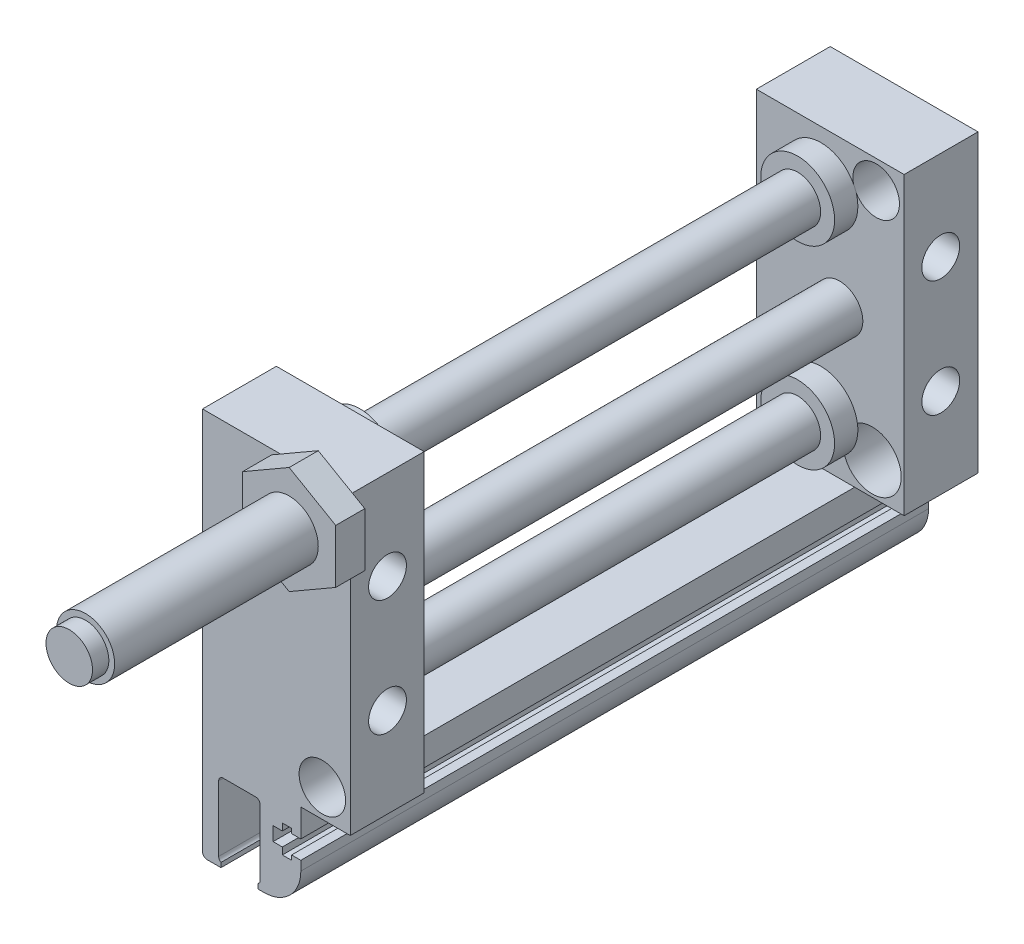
ISO-10303-21;
HEADER;
FILE_DESCRIPTION(('STEP AP214'),'2;1');
FILE_NAME('part.step','',(''),(''),'','','');
FILE_SCHEMA(('AUTOMOTIVE_DESIGN { 1 0 10303 214 1 1 1 1 }'));
ENDSEC;
DATA;
#1=APPLICATION_CONTEXT('core data for automotive mechanical design processes');
#2=APPLICATION_PROTOCOL_DEFINITION('international standard','automotive_design',2000,#1);
#3=PRODUCT_CONTEXT('',#1,'mechanical');
#4=PRODUCT('Part','Part','',(#3));
#5=PRODUCT_RELATED_PRODUCT_CATEGORY('part','',(#4));
#6=PRODUCT_DEFINITION_FORMATION('','',#4);
#7=PRODUCT_DEFINITION_CONTEXT('part definition',#1,'design');
#8=PRODUCT_DEFINITION('design','',#6,#7);
#9=PRODUCT_DEFINITION_SHAPE('','',#8);
#10=(LENGTH_UNIT() NAMED_UNIT(*) SI_UNIT(.MILLI.,.METRE.));
#11=(NAMED_UNIT(*) PLANE_ANGLE_UNIT() SI_UNIT($,.RADIAN.));
#12=(NAMED_UNIT(*) SI_UNIT($,.STERADIAN.) SOLID_ANGLE_UNIT());
#13=UNCERTAINTY_MEASURE_WITH_UNIT(LENGTH_MEASURE(1.E-05),#10,'distance_accuracy_value','');
#14=(GEOMETRIC_REPRESENTATION_CONTEXT(3) GLOBAL_UNCERTAINTY_ASSIGNED_CONTEXT((#13)) GLOBAL_UNIT_ASSIGNED_CONTEXT((#10,
#11,#12)) REPRESENTATION_CONTEXT('',''));
#15=CARTESIAN_POINT('',(0.,0.,0.));
#16=DIRECTION('',(0.,0.,1.));
#17=DIRECTION('',(1.,0.,0.));
#18=AXIS2_PLACEMENT_3D('',#15,#16,#17);
#19=CARTESIAN_POINT('',(0.,0.,0.));
#20=DIRECTION('',(0.,0.,1.));
#21=DIRECTION('',(1.,0.,0.));
#22=AXIS2_PLACEMENT_3D('',#19,#20,#21);
#23=PLANE('',#22);
#24=CARTESIAN_POINT('',(6.3,-20.6,0.));
#25=DIRECTION('',(0.,0.,1.));
#26=DIRECTION('',(1.,0.,0.));
#27=AXIS2_PLACEMENT_3D('',#24,#25,#26);
#28=CIRCLE('',#27,3.99999999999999);
#29=CARTESIAN_POINT('',(10.3,-20.6,0.));
#30=VERTEX_POINT('',#29);
#31=EDGE_CURVE('E797',#30,#30,#28,.T.);
#32=ORIENTED_EDGE('',*,*,#31,.F.);
#33=EDGE_LOOP('',(#32));
#34=FACE_BOUND('',#33,.T.);
#35=DIRECTION('',(0.,1.,0.));
#36=VECTOR('',#35,1.);
#37=CARTESIAN_POINT('',(11.1,-25.4,0.));
#38=LINE('',#37,#36);
#39=CARTESIAN_POINT('',(11.1,-25.4,0.));
#40=VERTEX_POINT('',#39);
#41=CARTESIAN_POINT('',(11.1,13.8378221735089,0.));
#42=VERTEX_POINT('',#41);
#43=EDGE_CURVE('E693',#40,#42,#38,.T.);
#44=ORIENTED_EDGE('',*,*,#43,.T.);
#45=DIRECTION('',(0.866025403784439,0.5,0.));
#46=VECTOR('',#45,1.);
#47=CARTESIAN_POINT('',(5.59999999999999,10.662395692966,0.));
#48=LINE('',#47,#46);
#49=CARTESIAN_POINT('',(5.59999999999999,10.662395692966,0.));
#50=VERTEX_POINT('',#49);
#51=EDGE_CURVE('E374',#50,#42,#48,.T.);
#52=ORIENTED_EDGE('',*,*,#51,.F.);
#53=DIRECTION('',(0.866025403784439,-0.5,0.));
#54=VECTOR('',#53,1.);
#55=CARTESIAN_POINT('',(-2.40000000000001,15.281197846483,0.));
#56=LINE('',#55,#54);
#57=CARTESIAN_POINT('',(-2.40000000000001,15.281197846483,0.));
#58=VERTEX_POINT('',#57);
#59=EDGE_CURVE('E366',#58,#50,#56,.T.);
#60=ORIENTED_EDGE('',*,*,#59,.F.);
#61=DIRECTION('',(0.,-1.,0.));
#62=VECTOR('',#61,1.);
#63=CARTESIAN_POINT('',(-2.40000000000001,24.518802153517,0.));
#64=LINE('',#63,#62);
#65=CARTESIAN_POINT('',(-2.40000000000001,24.518802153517,0.));
#66=VERTEX_POINT('',#65);
#67=EDGE_CURVE('E356',#66,#58,#64,.T.);
#68=ORIENTED_EDGE('',*,*,#67,.F.);
#69=DIRECTION('',(-0.866025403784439,-0.5,0.));
#70=VECTOR('',#69,1.);
#71=CARTESIAN_POINT('',(5.59999999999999,29.137604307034,0.));
#72=LINE('',#71,#70);
#73=CARTESIAN_POINT('',(-0.873720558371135,25.4,0.));
#74=VERTEX_POINT('',#73);
#75=EDGE_CURVE('E332',#74,#66,#72,.T.);
#76=ORIENTED_EDGE('',*,*,#75,.F.);
#77=DIRECTION('',(-1.,0.,0.));
#78=VECTOR('',#77,1.);
#79=CARTESIAN_POINT('',(11.1,25.4,0.));
#80=LINE('',#79,#78);
#81=CARTESIAN_POINT('',(-14.3,25.4,0.));
#82=VERTEX_POINT('',#81);
#83=EDGE_CURVE('E692',#74,#82,#80,.T.);
#84=ORIENTED_EDGE('',*,*,#83,.T.);
#85=DIRECTION('',(0.,-1.,0.));
#86=VECTOR('',#85,1.);
#87=CARTESIAN_POINT('',(-14.3,-25.4,0.));
#88=LINE('',#87,#86);
#89=CARTESIAN_POINT('',(-14.3,-40.506,0.));
#90=VERTEX_POINT('',#89);
#91=EDGE_CURVE('E672',#82,#90,#88,.T.);
#92=ORIENTED_EDGE('',*,*,#91,.T.);
#93=CARTESIAN_POINT('',(-13.506,-40.506,0.));
#94=DIRECTION('',(0.,0.,1.));
#95=DIRECTION('',(1.,0.,0.));
#96=AXIS2_PLACEMENT_3D('',#93,#94,#95);
#97=CIRCLE('',#96,0.79400000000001);
#98=CARTESIAN_POINT('',(-13.506,-41.3,0.));
#99=VERTEX_POINT('',#98);
#100=EDGE_CURVE('E554',#99,#90,#97,.F.);
#101=ORIENTED_EDGE('',*,*,#100,.F.);
#102=DIRECTION('',(-1.,0.,0.));
#103=VECTOR('',#102,1.);
#104=CARTESIAN_POINT('',(-11.125,-41.3,0.));
#105=LINE('',#104,#103);
#106=CARTESIAN_POINT('',(-11.125,-41.3,0.));
#107=VERTEX_POINT('',#106);
#108=EDGE_CURVE('E559',#107,#99,#105,.T.);
#109=ORIENTED_EDGE('',*,*,#108,.F.);
#110=DIRECTION('',(0.,-1.,0.));
#111=VECTOR('',#110,1.);
#112=CARTESIAN_POINT('',(-11.125,-40.513,0.));
#113=LINE('',#112,#111);
#114=CARTESIAN_POINT('',(-11.125,-40.513,0.));
#115=VERTEX_POINT('',#114);
#116=EDGE_CURVE('E563',#115,#107,#113,.T.);
#117=ORIENTED_EDGE('',*,*,#116,.F.);
#118=CARTESIAN_POINT('',(-10.728,-39.8253758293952,0.));
#119=DIRECTION('',(0.,0.,1.));
#120=DIRECTION('',(1.,0.,0.));
#121=AXIS2_PLACEMENT_3D('',#118,#119,#120);
#122=CIRCLE('',#121,0.794000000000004);
#123=CARTESIAN_POINT('',(-11.522,-39.8253758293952,0.));
#124=VERTEX_POINT('',#123);
#125=EDGE_CURVE('E567',#124,#115,#122,.T.);
#126=ORIENTED_EDGE('',*,*,#125,.F.);
#127=DIRECTION('',(0.,-1.,0.));
#128=VECTOR('',#127,1.);
#129=CARTESIAN_POINT('',(-11.522,-28.575,0.));
#130=LINE('',#129,#128);
#131=CARTESIAN_POINT('',(-11.522,-28.575,0.));
#132=VERTEX_POINT('',#131);
#133=EDGE_CURVE('E571',#132,#124,#130,.T.);
#134=ORIENTED_EDGE('',*,*,#133,.F.);
#135=CARTESIAN_POINT('',(-10.728,-28.575,0.));
#136=DIRECTION('',(0.,0.,1.));
#137=DIRECTION('',(1.,0.,0.));
#138=AXIS2_PLACEMENT_3D('',#135,#136,#137);
#139=CIRCLE('',#138,0.794000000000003);
#140=CARTESIAN_POINT('',(-10.728,-27.781,0.));
#141=VERTEX_POINT('',#140);
#142=EDGE_CURVE('E575',#141,#132,#139,.T.);
#143=ORIENTED_EDGE('',*,*,#142,.F.);
#144=DIRECTION('',(-1.,0.,0.));
#145=VECTOR('',#144,1.);
#146=CARTESIAN_POINT('',(-5.17200000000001,-27.781,0.));
#147=LINE('',#146,#145);
#148=CARTESIAN_POINT('',(-5.17200000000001,-27.781,0.));
#149=VERTEX_POINT('',#148);
#150=EDGE_CURVE('E579',#149,#141,#147,.T.);
#151=ORIENTED_EDGE('',*,*,#150,.F.);
#152=CARTESIAN_POINT('',(-5.17200000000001,-28.575,0.));
#153=DIRECTION('',(0.,0.,1.));
#154=DIRECTION('',(1.,0.,0.));
#155=AXIS2_PLACEMENT_3D('',#152,#153,#154);
#156=CIRCLE('',#155,0.794000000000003);
#157=CARTESIAN_POINT('',(-4.378,-28.575,0.));
#158=VERTEX_POINT('',#157);
#159=EDGE_CURVE('E583',#158,#149,#156,.T.);
#160=ORIENTED_EDGE('',*,*,#159,.F.);
#161=DIRECTION('',(0.,1.,0.));
#162=VECTOR('',#161,1.);
#163=CARTESIAN_POINT('',(-4.378,-28.575,0.));
#164=LINE('',#163,#162);
#165=CARTESIAN_POINT('',(-4.378,-39.8253758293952,0.));
#166=VERTEX_POINT('',#165);
#167=EDGE_CURVE('E587',#166,#158,#164,.T.);
#168=ORIENTED_EDGE('',*,*,#167,.F.);
#169=CARTESIAN_POINT('',(-5.17200000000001,-39.8253758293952,0.));
#170=DIRECTION('',(0.,0.,1.));
#171=DIRECTION('',(1.,0.,0.));
#172=AXIS2_PLACEMENT_3D('',#169,#170,#171);
#173=CIRCLE('',#172,0.794000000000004);
#174=CARTESIAN_POINT('',(-4.775,-40.513,0.));
#175=VERTEX_POINT('',#174);
#176=EDGE_CURVE('E591',#175,#166,#173,.T.);
#177=ORIENTED_EDGE('',*,*,#176,.F.);
#178=DIRECTION('',(0.,1.,0.));
#179=VECTOR('',#178,1.);
#180=CARTESIAN_POINT('',(-4.775,-41.3,0.));
#181=LINE('',#180,#179);
#182=CARTESIAN_POINT('',(-4.775,-41.3,0.));
#183=VERTEX_POINT('',#182);
#184=EDGE_CURVE('E595',#183,#175,#181,.T.);
#185=ORIENTED_EDGE('',*,*,#184,.F.);
#186=DIRECTION('',(-1.,0.,0.));
#187=VECTOR('',#186,1.);
#188=CARTESIAN_POINT('',(-4.775,-41.3,0.));
#189=LINE('',#188,#187);
#190=CARTESIAN_POINT('',(-3.75,-41.3,0.));
#191=VERTEX_POINT('',#190);
#192=EDGE_CURVE('E599',#191,#183,#189,.T.);
#193=ORIENTED_EDGE('',*,*,#192,.F.);
#194=CARTESIAN_POINT('',(-3.75,-34.95,0.));
#195=DIRECTION('',(0.,0.,1.));
#196=DIRECTION('',(1.,0.,0.));
#197=AXIS2_PLACEMENT_3D('',#194,#195,#196);
#198=CIRCLE('',#197,6.35);
#199=CARTESIAN_POINT('',(2.6,-34.95,0.));
#200=VERTEX_POINT('',#199);
#201=EDGE_CURVE('E603',#200,#191,#198,.F.);
#202=ORIENTED_EDGE('',*,*,#201,.F.);
#203=DIRECTION('',(0.,-1.,0.));
#204=VECTOR('',#203,1.);
#205=CARTESIAN_POINT('',(2.6,-33.3375,0.));
#206=LINE('',#205,#204);
#207=CARTESIAN_POINT('',(2.6,-33.3375,0.));
#208=VERTEX_POINT('',#207);
#209=EDGE_CURVE('E607',#208,#200,#206,.T.);
#210=ORIENTED_EDGE('',*,*,#209,.F.);
#211=DIRECTION('',(1.,0.,0.));
#212=VECTOR('',#211,1.);
#213=CARTESIAN_POINT('',(1.012,-33.3375,0.));
#214=LINE('',#213,#212);
#215=CARTESIAN_POINT('',(1.012,-33.3375,0.));
#216=VERTEX_POINT('',#215);
#217=EDGE_CURVE('E611',#216,#208,#214,.T.);
#218=ORIENTED_EDGE('',*,*,#217,.F.);
#219=DIRECTION('',(0.,1.,0.));
#220=VECTOR('',#219,1.);
#221=CARTESIAN_POINT('',(1.012,-34.1315,0.));
#222=LINE('',#221,#220);
#223=CARTESIAN_POINT('',(1.012,-34.1315,0.));
#224=VERTEX_POINT('',#223);
#225=EDGE_CURVE('E615',#224,#216,#222,.T.);
#226=ORIENTED_EDGE('',*,*,#225,.F.);
#227=DIRECTION('',(1.,0.,0.));
#228=VECTOR('',#227,1.);
#229=CARTESIAN_POINT('',(-0.576000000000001,-34.1315,0.));
#230=LINE('',#229,#228);
#231=CARTESIAN_POINT('',(-0.576000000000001,-34.1315,0.));
#232=VERTEX_POINT('',#231);
#233=EDGE_CURVE('E619',#232,#224,#230,.T.);
#234=ORIENTED_EDGE('',*,*,#233,.F.);
#235=DIRECTION('',(0.,-1.,0.));
#236=VECTOR('',#235,1.);
#237=CARTESIAN_POINT('',(-0.576000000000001,-32.9405,0.));
#238=LINE('',#237,#236);
#239=CARTESIAN_POINT('',(-0.576000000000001,-32.9405,0.));
#240=VERTEX_POINT('',#239);
#241=EDGE_CURVE('E623',#240,#232,#238,.T.);
#242=ORIENTED_EDGE('',*,*,#241,.F.);
#243=DIRECTION('',(1.,0.,0.));
#244=VECTOR('',#243,1.);
#245=CARTESIAN_POINT('',(-2.163,-32.9405,0.));
#246=LINE('',#245,#244);
#247=CARTESIAN_POINT('',(-2.163,-32.9405,0.));
#248=VERTEX_POINT('',#247);
#249=EDGE_CURVE('E627',#248,#240,#246,.T.);
#250=ORIENTED_EDGE('',*,*,#249,.F.);
#251=DIRECTION('',(0.,-1.,0.));
#252=VECTOR('',#251,1.);
#253=CARTESIAN_POINT('',(-2.163,-30.5595,0.));
#254=LINE('',#253,#252);
#255=CARTESIAN_POINT('',(-2.163,-30.5595,0.));
#256=VERTEX_POINT('',#255);
#257=EDGE_CURVE('E631',#256,#248,#254,.T.);
#258=ORIENTED_EDGE('',*,*,#257,.F.);
#259=DIRECTION('',(-1.,0.,0.));
#260=VECTOR('',#259,1.);
#261=CARTESIAN_POINT('',(-0.576000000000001,-30.5595,0.));
#262=LINE('',#261,#260);
#263=CARTESIAN_POINT('',(-0.576000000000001,-30.5595,0.));
#264=VERTEX_POINT('',#263);
#265=EDGE_CURVE('E635',#264,#256,#262,.T.);
#266=ORIENTED_EDGE('',*,*,#265,.F.);
#267=DIRECTION('',(0.,-1.,0.));
#268=VECTOR('',#267,1.);
#269=CARTESIAN_POINT('',(-0.576000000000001,-29.3685,0.));
#270=LINE('',#269,#268);
#271=CARTESIAN_POINT('',(-0.576000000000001,-29.3685,0.));
#272=VERTEX_POINT('',#271);
#273=EDGE_CURVE('E639',#272,#264,#270,.T.);
#274=ORIENTED_EDGE('',*,*,#273,.F.);
#275=DIRECTION('',(-1.,0.,0.));
#276=VECTOR('',#275,1.);
#277=CARTESIAN_POINT('',(1.012,-29.3685,0.));
#278=LINE('',#277,#276);
#279=CARTESIAN_POINT('',(1.012,-29.3685,0.));
#280=VERTEX_POINT('',#279);
#281=EDGE_CURVE('E643',#280,#272,#278,.T.);
#282=ORIENTED_EDGE('',*,*,#281,.F.);
#283=DIRECTION('',(0.,1.,0.));
#284=VECTOR('',#283,1.);
#285=CARTESIAN_POINT('',(1.012,-30.1625,0.));
#286=LINE('',#285,#284);
#287=CARTESIAN_POINT('',(1.012,-30.1625,0.));
#288=VERTEX_POINT('',#287);
#289=EDGE_CURVE('E647',#288,#280,#286,.T.);
#290=ORIENTED_EDGE('',*,*,#289,.F.);
#291=DIRECTION('',(-1.,0.,0.));
#292=VECTOR('',#291,1.);
#293=CARTESIAN_POINT('',(2.6,-30.1625,0.));
#294=LINE('',#293,#292);
#295=CARTESIAN_POINT('',(2.6,-30.1625,0.));
#296=VERTEX_POINT('',#295);
#297=EDGE_CURVE('E478',#296,#288,#294,.T.);
#298=ORIENTED_EDGE('',*,*,#297,.F.);
#299=DIRECTION('',(0.,-1.,0.));
#300=VECTOR('',#299,1.);
#301=CARTESIAN_POINT('',(2.6,-25.4,0.));
#302=LINE('',#301,#300);
#303=CARTESIAN_POINT('',(2.6,-25.4,0.));
#304=VERTEX_POINT('',#303);
#305=EDGE_CURVE('E666',#304,#296,#302,.T.);
#306=ORIENTED_EDGE('',*,*,#305,.F.);
#307=DIRECTION('',(1.,0.,0.));
#308=VECTOR('',#307,1.);
#309=CARTESIAN_POINT('',(11.1,-25.4,0.));
#310=LINE('',#309,#308);
#311=EDGE_CURVE('E696',#304,#40,#310,.T.);
#312=ORIENTED_EDGE('',*,*,#311,.T.);
#313=EDGE_LOOP('',(#44,#52,#60,#68,#76,#84,#92,#101,#109,#117,#126,#134,#143,#151,#160,#168,
#177,#185,#193,#202,#210,#218,#226,#234,#242,#250,#258,#266,#274,#282,#290,#298,#306,#312));
#314=FACE_BOUND('',#313,.T.);
#315=ADVANCED_FACE('F32',(#34,#314),#23,.T.);
#316=CARTESIAN_POINT('',(-5.17200000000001,-27.781,23.2038789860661));
#317=DIRECTION('',(0.,-1.,0.));
#318=DIRECTION('',(0.,0.,-1.));
#319=AXIS2_PLACEMENT_3D('',#316,#317,#318);
#320=PLANE('',#319);
#321=CARTESIAN_POINT('',(-7.95000000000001,-27.781,-98.35));
#322=DIRECTION('',(0.,-1.,0.));
#323=DIRECTION('',(0.,0.,-1.));
#324=AXIS2_PLACEMENT_3D('',#321,#322,#323);
#325=CIRCLE('',#324,1.9845);
#326=CARTESIAN_POINT('',(-7.95000000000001,-27.781,-100.3345));
#327=VERTEX_POINT('',#326);
#328=EDGE_CURVE('E445',#327,#327,#325,.T.);
#329=ORIENTED_EDGE('',*,*,#328,.F.);
#330=EDGE_LOOP('',(#329));
#331=FACE_BOUND('',#330,.T.);
#332=DIRECTION('',(0.,0.,-1.));
#333=VECTOR('',#332,1.);
#334=CARTESIAN_POINT('',(-5.17200000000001,-27.781,23.2038789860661));
#335=LINE('',#334,#333);
#336=CARTESIAN_POINT('',(-5.17200000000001,-27.781,-107.9));
#337=VERTEX_POINT('',#336);
#338=EDGE_CURVE('E582',#149,#337,#335,.T.);
#339=ORIENTED_EDGE('',*,*,#338,.F.);
#340=ORIENTED_EDGE('',*,*,#150,.T.);
#341=DIRECTION('',(0.,0.,-1.));
#342=VECTOR('',#341,1.);
#343=CARTESIAN_POINT('',(-10.728,-27.781,23.2038789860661));
#344=LINE('',#343,#342);
#345=CARTESIAN_POINT('',(-10.728,-27.781,-107.9));
#346=VERTEX_POINT('',#345);
#347=EDGE_CURVE('E578',#141,#346,#344,.T.);
#348=ORIENTED_EDGE('',*,*,#347,.T.);
#349=DIRECTION('',(-1.,0.,0.));
#350=VECTOR('',#349,1.);
#351=CARTESIAN_POINT('',(-5.17200000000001,-27.781,-107.9));
#352=LINE('',#351,#350);
#353=EDGE_CURVE('E494',#337,#346,#352,.T.);
#354=ORIENTED_EDGE('',*,*,#353,.F.);
#355=EDGE_LOOP('',(#339,#340,#348,#354));
#356=FACE_BOUND('',#355,.T.);
#357=CARTESIAN_POINT('',(-7.95000000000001,-27.781,-9.55));
#358=DIRECTION('',(0.,-1.,0.));
#359=DIRECTION('',(0.,0.,-1.));
#360=AXIS2_PLACEMENT_3D('',#357,#358,#359);
#361=CIRCLE('',#360,1.9845);
#362=CARTESIAN_POINT('',(-7.95000000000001,-27.781,-11.5345));
#363=VERTEX_POINT('',#362);
#364=EDGE_CURVE('E441',#363,#363,#361,.T.);
#365=ORIENTED_EDGE('',*,*,#364,.F.);
#366=EDGE_LOOP('',(#365));
#367=FACE_BOUND('',#366,.T.);
#368=ADVANCED_FACE('F910',(#331,#356,#367),#320,.T.);
#369=CARTESIAN_POINT('',(11.1,-25.4,-164.696126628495));
#370=DIRECTION('',(0.,-1.,0.));
#371=DIRECTION('',(1.,0.,0.));
#372=AXIS2_PLACEMENT_3D('',#369,#370,#371);
#373=PLANE('',#372);
#374=DIRECTION('',(1.,0.,0.));
#375=VECTOR('',#374,1.);
#376=CARTESIAN_POINT('',(11.1,-25.4,-95.201));
#377=LINE('',#376,#375);
#378=CARTESIAN_POINT('',(2.6,-25.4,-95.201));
#379=VERTEX_POINT('',#378);
#380=CARTESIAN_POINT('',(11.1,-25.4,-95.201));
#381=VERTEX_POINT('',#380);
#382=EDGE_CURVE('E710',#379,#381,#377,.T.);
#383=ORIENTED_EDGE('',*,*,#382,.F.);
#384=DIRECTION('',(0.,0.,-1.));
#385=VECTOR('',#384,1.);
#386=CARTESIAN_POINT('',(2.6,-25.4,23.2038789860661));
#387=LINE('',#386,#385);
#388=CARTESIAN_POINT('',(2.6,-25.4,-107.9));
#389=VERTEX_POINT('',#388);
#390=EDGE_CURVE('E39',#379,#389,#387,.T.);
#391=ORIENTED_EDGE('',*,*,#390,.T.);
#392=DIRECTION('',(-1.,0.,0.));
#393=VECTOR('',#392,1.);
#394=CARTESIAN_POINT('',(11.1,-25.4,-107.9));
#395=LINE('',#394,#393);
#396=CARTESIAN_POINT('',(11.1,-25.4,-107.9));
#397=VERTEX_POINT('',#396);
#398=EDGE_CURVE('E735',#397,#389,#395,.T.);
#399=ORIENTED_EDGE('',*,*,#398,.F.);
#400=DIRECTION('',(0.,0.,1.));
#401=VECTOR('',#400,1.);
#402=CARTESIAN_POINT('',(11.1,-25.4,-164.696126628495));
#403=LINE('',#402,#401);
#404=EDGE_CURVE('E729',#397,#381,#403,.T.);
#405=ORIENTED_EDGE('',*,*,#404,.T.);
#406=EDGE_LOOP('',(#383,#391,#399,#405));
#407=FACE_BOUND('',#406,.T.);
#408=ADVANCED_FACE('F878',(#407),#373,.T.);
#409=CARTESIAN_POINT('',(-14.3,-25.4,-12.699));
#410=DIRECTION('',(0.,0.,-1.));
#411=DIRECTION('',(-1.,0.,0.));
#412=AXIS2_PLACEMENT_3D('',#409,#410,#411);
#413=PLANE('',#412);
#414=CARTESIAN_POINT('',(5.59999999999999,19.9,-12.699));
#415=DIRECTION('',(0.,0.,-1.));
#416=DIRECTION('',(-1.,0.,0.));
#417=AXIS2_PLACEMENT_3D('',#414,#415,#416);
#418=CIRCLE('',#417,5.);
#419=CARTESIAN_POINT('',(3.06131500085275,15.5924393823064,-12.699));
#420=VERTEX_POINT('',#419);
#421=CARTESIAN_POINT('',(0.870891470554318,21.5234323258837,-12.699));
#422=VERTEX_POINT('',#421);
#423=EDGE_CURVE('E471',#420,#422,#418,.F.);
#424=ORIENTED_EDGE('',*,*,#423,.T.);
#425=CARTESIAN_POINT('',(-3.2,16.65,-12.699));
#426=DIRECTION('',(0.,0.,1.));
#427=DIRECTION('',(1.,0.,0.));
#428=AXIS2_PLACEMENT_3D('',#425,#426,#427);
#429=CIRCLE('',#428,6.35);
#430=EDGE_CURVE('E742',#422,#420,#429,.T.);
#431=ORIENTED_EDGE('',*,*,#430,.T.);
#432=EDGE_LOOP('',(#424,#431));
#433=FACE_BOUND('',#432,.T.);
#434=CARTESIAN_POINT('',(6.3,-20.6,-12.699));
#435=DIRECTION('',(0.,0.,-1.));
#436=DIRECTION('',(-1.,0.,0.));
#437=AXIS2_PLACEMENT_3D('',#434,#435,#436);
#438=CIRCLE('',#437,3.99999999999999);
#439=CARTESIAN_POINT('',(2.430830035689,-19.585345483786,-12.699));
#440=VERTEX_POINT('',#439);
#441=CARTESIAN_POINT('',(2.85205416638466,-18.5722747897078,-12.699));
#442=VERTEX_POINT('',#441);
#443=EDGE_CURVE('E796',#440,#442,#438,.F.);
#444=ORIENTED_EDGE('',*,*,#443,.T.);
#445=CARTESIAN_POINT('',(-3.2,-16.65,-12.699));
#446=DIRECTION('',(0.,0.,1.));
#447=DIRECTION('',(1.,0.,0.));
#448=AXIS2_PLACEMENT_3D('',#445,#446,#447);
#449=CIRCLE('',#448,6.35);
#450=EDGE_CURVE('E793',#442,#440,#449,.T.);
#451=ORIENTED_EDGE('',*,*,#450,.T.);
#452=EDGE_LOOP('',(#444,#451));
#453=FACE_BOUND('',#452,.T.);
#454=CARTESIAN_POINT('',(0.,0.,-12.699));
#455=DIRECTION('',(0.,0.,-1.));
#456=DIRECTION('',(-1.,0.,0.));
#457=AXIS2_PLACEMENT_3D('',#454,#455,#456);
#458=CIRCLE('',#457,4.);
#459=CARTESIAN_POINT('',(-4.,0.,-12.699));
#460=VERTEX_POINT('',#459);
#461=EDGE_CURVE('E716',#460,#460,#458,.T.);
#462=ORIENTED_EDGE('',*,*,#461,.F.);
#463=EDGE_LOOP('',(#462));
#464=FACE_BOUND('',#463,.T.);
#465=DIRECTION('',(1.,0.,0.));
#466=VECTOR('',#465,1.);
#467=CARTESIAN_POINT('',(11.1,-25.4,-12.699));
#468=LINE('',#467,#466);
#469=CARTESIAN_POINT('',(-14.3,-25.4,-12.699));
#470=VERTEX_POINT('',#469);
#471=CARTESIAN_POINT('',(2.6,-25.4,-12.699));
#472=VERTEX_POINT('',#471);
#473=EDGE_CURVE('E676',#470,#472,#468,.T.);
#474=ORIENTED_EDGE('',*,*,#473,.F.);
#475=DIRECTION('',(0.,-1.,0.));
#476=VECTOR('',#475,1.);
#477=CARTESIAN_POINT('',(-14.3,-25.4,-12.699));
#478=LINE('',#477,#476);
#479=CARTESIAN_POINT('',(-14.3,25.4,-12.699));
#480=VERTEX_POINT('',#479);
#481=EDGE_CURVE('E669',#480,#470,#478,.T.);
#482=ORIENTED_EDGE('',*,*,#481,.F.);
#483=DIRECTION('',(-1.,0.,0.));
#484=VECTOR('',#483,1.);
#485=CARTESIAN_POINT('',(11.1,25.4,-12.699));
#486=LINE('',#485,#484);
#487=CARTESIAN_POINT('',(11.1,25.4,-12.699));
#488=VERTEX_POINT('',#487);
#489=EDGE_CURVE('E752',#488,#480,#486,.T.);
#490=ORIENTED_EDGE('',*,*,#489,.F.);
#491=DIRECTION('',(0.,1.,0.));
#492=VECTOR('',#491,1.);
#493=CARTESIAN_POINT('',(11.1,-25.4,-12.699));
#494=LINE('',#493,#492);
#495=CARTESIAN_POINT('',(11.1,-25.4,-12.699));
#496=VERTEX_POINT('',#495);
#497=EDGE_CURVE('E687',#496,#488,#494,.T.);
#498=ORIENTED_EDGE('',*,*,#497,.F.);
#499=EDGE_CURVE('E681',#472,#496,#468,.T.);
#500=ORIENTED_EDGE('',*,*,#499,.F.);
#501=EDGE_LOOP('',(#474,#482,#490,#498,#500));
#502=FACE_BOUND('',#501,.T.);
#503=ADVANCED_FACE('F864',(#433,#453,#464,#502),#413,.T.);
#504=CARTESIAN_POINT('',(-14.3,-25.4,-95.201));
#505=DIRECTION('',(0.,0.,-1.));
#506=DIRECTION('',(-1.,0.,0.));
#507=AXIS2_PLACEMENT_3D('',#504,#505,#506);
#508=PLANE('',#507);
#509=CARTESIAN_POINT('',(0.,0.,-95.201));
#510=DIRECTION('',(0.,0.,-1.));
#511=DIRECTION('',(-1.,0.,0.));
#512=AXIS2_PLACEMENT_3D('',#509,#510,#511);
#513=CIRCLE('',#512,4.);
#514=CARTESIAN_POINT('',(-4.,0.,-95.201));
#515=VERTEX_POINT('',#514);
#516=EDGE_CURVE('E691',#515,#515,#513,.F.);
#517=ORIENTED_EDGE('',*,*,#516,.F.);
#518=EDGE_LOOP('',(#517));
#519=FACE_BOUND('',#518,.T.);
#520=CARTESIAN_POINT('',(-14.3,-25.4,-95.201));
#521=VERTEX_POINT('',#520);
#522=EDGE_CURVE('E705',#521,#379,#377,.T.);
#523=ORIENTED_EDGE('',*,*,#522,.T.);
#524=ORIENTED_EDGE('',*,*,#382,.T.);
#525=DIRECTION('',(0.,1.,0.));
#526=VECTOR('',#525,1.);
#527=CARTESIAN_POINT('',(11.1,-25.4,-95.201));
#528=LINE('',#527,#526);
#529=CARTESIAN_POINT('',(11.1,25.4,-95.201));
#530=VERTEX_POINT('',#529);
#531=EDGE_CURVE('E709',#381,#530,#528,.T.);
#532=ORIENTED_EDGE('',*,*,#531,.T.);
#533=DIRECTION('',(-1.,0.,0.));
#534=VECTOR('',#533,1.);
#535=CARTESIAN_POINT('',(11.1,25.4,-95.201));
#536=LINE('',#535,#534);
#537=CARTESIAN_POINT('',(-14.3,25.4,-95.201));
#538=VERTEX_POINT('',#537);
#539=EDGE_CURVE('E721',#530,#538,#536,.T.);
#540=ORIENTED_EDGE('',*,*,#539,.T.);
#541=DIRECTION('',(0.,-1.,0.));
#542=VECTOR('',#541,1.);
#543=CARTESIAN_POINT('',(-14.3,-25.4,-95.201));
#544=LINE('',#543,#542);
#545=EDGE_CURVE('E711',#538,#521,#544,.T.);
#546=ORIENTED_EDGE('',*,*,#545,.T.);
#547=EDGE_LOOP('',(#523,#524,#532,#540,#546));
#548=FACE_BOUND('',#547,.T.);
#549=CARTESIAN_POINT('',(-3.2,16.65,-95.201));
#550=DIRECTION('',(0.,0.,-1.));
#551=DIRECTION('',(-1.,0.,0.));
#552=AXIS2_PLACEMENT_3D('',#549,#550,#551);
#553=CIRCLE('',#552,6.35000000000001);
#554=CARTESIAN_POINT('',(2.85205416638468,18.5722747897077,-95.201));
#555=VERTEX_POINT('',#554);
#556=CARTESIAN_POINT('',(2.43083003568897,19.585345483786,-95.201));
#557=VERTEX_POINT('',#556);
#558=EDGE_CURVE('E734',#555,#557,#553,.T.);
#559=ORIENTED_EDGE('',*,*,#558,.T.);
#560=CARTESIAN_POINT('',(6.3,20.6,-95.201));
#561=DIRECTION('',(0.,0.,-1.));
#562=DIRECTION('',(-1.,0.,0.));
#563=AXIS2_PLACEMENT_3D('',#560,#561,#562);
#564=CIRCLE('',#563,4.);
#565=EDGE_CURVE('E803',#555,#557,#564,.F.);
#566=ORIENTED_EDGE('',*,*,#565,.F.);
#567=EDGE_LOOP('',(#559,#566));
#568=FACE_BOUND('',#567,.T.);
#569=CARTESIAN_POINT('',(-3.2,-16.65,-95.201));
#570=DIRECTION('',(0.,0.,-1.));
#571=DIRECTION('',(-1.,0.,0.));
#572=AXIS2_PLACEMENT_3D('',#569,#570,#571);
#573=CIRCLE('',#572,6.35000000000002);
#574=CARTESIAN_POINT('',(3.06131500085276,-15.5924393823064,-95.201));
#575=VERTEX_POINT('',#574);
#576=CARTESIAN_POINT('',(0.870891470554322,-21.5234323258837,-95.201));
#577=VERTEX_POINT('',#576);
#578=EDGE_CURVE('E767',#575,#577,#573,.F.);
#579=ORIENTED_EDGE('',*,*,#578,.F.);
#580=CARTESIAN_POINT('',(5.6,-19.9,-95.201));
#581=DIRECTION('',(0.,0.,-1.));
#582=DIRECTION('',(-1.,0.,0.));
#583=AXIS2_PLACEMENT_3D('',#580,#581,#582);
#584=CIRCLE('',#583,5.);
#585=EDGE_CURVE('E53',#577,#575,#584,.F.);
#586=ORIENTED_EDGE('',*,*,#585,.F.);
#587=EDGE_LOOP('',(#579,#586));
#588=FACE_BOUND('',#587,.T.);
#589=ADVANCED_FACE('F883',(#519,#548,#568,#588),#508,.F.);
#590=CARTESIAN_POINT('',(11.1,-25.4,56.7961266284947));
#591=DIRECTION('',(0.,1.,0.));
#592=DIRECTION('',(-1.,0.,0.));
#593=AXIS2_PLACEMENT_3D('',#590,#591,#592);
#594=PLANE('',#593);
#595=ORIENTED_EDGE('',*,*,#311,.F.);
#596=EDGE_CURVE('E654',#304,#472,#387,.T.);
#597=ORIENTED_EDGE('',*,*,#596,.T.);
#598=ORIENTED_EDGE('',*,*,#499,.T.);
#599=DIRECTION('',(0.,0.,-1.));
#600=VECTOR('',#599,1.);
#601=CARTESIAN_POINT('',(11.1,-25.4,56.7961266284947));
#602=LINE('',#601,#600);
#603=EDGE_CURVE('E680',#40,#496,#602,.T.);
#604=ORIENTED_EDGE('',*,*,#603,.F.);
#605=EDGE_LOOP('',(#595,#597,#598,#604));
#606=FACE_BOUND('',#605,.T.);
#607=ADVANCED_FACE('F871',(#606),#594,.F.);
#608=CARTESIAN_POINT('',(11.1,-25.4,56.7961266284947));
#609=DIRECTION('',(-1.,0.,0.));
#610=DIRECTION('',(0.,-1.,0.));
#611=AXIS2_PLACEMENT_3D('',#608,#609,#610);
#612=PLANE('',#611);
#613=CARTESIAN_POINT('',(11.1,10.,-6.4));
#614=DIRECTION('',(1.,0.,0.));
#615=DIRECTION('',(0.,0.,-1.));
#616=AXIS2_PLACEMENT_3D('',#613,#614,#615);
#617=CIRCLE('',#616,3.25);
#618=CARTESIAN_POINT('',(11.1,10.,-9.65));
#619=VERTEX_POINT('',#618);
#620=EDGE_CURVE('E383',#619,#619,#617,.T.);
#621=ORIENTED_EDGE('',*,*,#620,.F.);
#622=EDGE_LOOP('',(#621));
#623=FACE_BOUND('',#622,.T.);
#624=CARTESIAN_POINT('',(11.1,-10.,-6.4));
#625=DIRECTION('',(1.,0.,0.));
#626=DIRECTION('',(0.,0.,-1.));
#627=AXIS2_PLACEMENT_3D('',#624,#625,#626);
#628=CIRCLE('',#627,3.25);
#629=CARTESIAN_POINT('',(11.1,-10.,-9.65));
#630=VERTEX_POINT('',#629);
#631=EDGE_CURVE('E393',#630,#630,#628,.T.);
#632=ORIENTED_EDGE('',*,*,#631,.F.);
#633=EDGE_LOOP('',(#632));
#634=FACE_BOUND('',#633,.T.);
#635=ORIENTED_EDGE('',*,*,#43,.F.);
#636=ORIENTED_EDGE('',*,*,#603,.T.);
#637=ORIENTED_EDGE('',*,*,#497,.T.);
#638=DIRECTION('',(0.,0.,-1.));
#639=VECTOR('',#638,1.);
#640=CARTESIAN_POINT('',(11.1,25.4,56.7961266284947));
#641=LINE('',#640,#639);
#642=CARTESIAN_POINT('',(11.1,25.4,0.));
#643=VERTEX_POINT('',#642);
#644=EDGE_CURVE('E754',#643,#488,#641,.T.);
#645=ORIENTED_EDGE('',*,*,#644,.F.);
#646=DIRECTION('',(0.,-1.,0.));
#647=VECTOR('',#646,1.);
#648=CARTESIAN_POINT('',(11.1,-25.4,0.));
#649=LINE('',#648,#647);
#650=EDGE_CURVE('E348',#643,#42,#649,.T.);
#651=ORIENTED_EDGE('',*,*,#650,.T.);
#652=EDGE_LOOP('',(#635,#636,#637,#645,#651));
#653=FACE_BOUND('',#652,.T.);
#654=ADVANCED_FACE('F858',(#623,#634,#653),#612,.F.);
#655=CARTESIAN_POINT('',(11.1,25.4,56.7961266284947));
#656=DIRECTION('',(0.,-1.,0.));
#657=DIRECTION('',(1.,0.,0.));
#658=AXIS2_PLACEMENT_3D('',#655,#656,#657);
#659=PLANE('',#658);
#660=EDGE_CURVE('E689',#643,#74,#80,.T.);
#661=ORIENTED_EDGE('',*,*,#660,.F.);
#662=ORIENTED_EDGE('',*,*,#644,.T.);
#663=ORIENTED_EDGE('',*,*,#489,.T.);
#664=DIRECTION('',(0.,0.,-1.));
#665=VECTOR('',#664,1.);
#666=CARTESIAN_POINT('',(-14.3,25.4,56.7961266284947));
#667=LINE('',#666,#665);
#668=EDGE_CURVE('E673',#82,#480,#667,.T.);
#669=ORIENTED_EDGE('',*,*,#668,.F.);
#670=ORIENTED_EDGE('',*,*,#83,.F.);
#671=EDGE_LOOP('',(#661,#662,#663,#669,#670));
#672=FACE_BOUND('',#671,.T.);
#673=ADVANCED_FACE('F854',(#672),#659,.F.);
#674=CARTESIAN_POINT('',(-14.3,-25.4,56.7961266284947));
#675=DIRECTION('',(1.,0.,0.));
#676=DIRECTION('',(0.,1.,0.));
#677=AXIS2_PLACEMENT_3D('',#674,#675,#676);
#678=PLANE('',#677);
#679=CARTESIAN_POINT('',(-14.3,10.,-101.5));
#680=DIRECTION('',(-1.,0.,0.));
#681=DIRECTION('',(0.,0.,1.));
#682=AXIS2_PLACEMENT_3D('',#679,#680,#681);
#683=CIRCLE('',#682,2.);
#684=CARTESIAN_POINT('',(-14.3,10.,-99.5));
#685=VERTEX_POINT('',#684);
#686=EDGE_CURVE('E420',#685,#685,#683,.T.);
#687=ORIENTED_EDGE('',*,*,#686,.F.);
#688=EDGE_LOOP('',(#687));
#689=FACE_BOUND('',#688,.T.);
#690=CARTESIAN_POINT('',(-14.3,10.,-6.4));
#691=DIRECTION('',(-1.,0.,0.));
#692=DIRECTION('',(0.,0.,1.));
#693=AXIS2_PLACEMENT_3D('',#690,#691,#692);
#694=CIRCLE('',#693,2.);
#695=CARTESIAN_POINT('',(-14.3,10.,-4.4));
#696=VERTEX_POINT('',#695);
#697=EDGE_CURVE('E426',#696,#696,#694,.T.);
#698=ORIENTED_EDGE('',*,*,#697,.F.);
#699=EDGE_LOOP('',(#698));
#700=FACE_BOUND('',#699,.T.);
#701=CARTESIAN_POINT('',(-14.3,-10.,-6.4));
#702=DIRECTION('',(-1.,0.,0.));
#703=DIRECTION('',(0.,0.,1.));
#704=AXIS2_PLACEMENT_3D('',#701,#702,#703);
#705=CIRCLE('',#704,2.);
#706=CARTESIAN_POINT('',(-14.3,-10.,-4.4));
#707=VERTEX_POINT('',#706);
#708=EDGE_CURVE('E432',#707,#707,#705,.T.);
#709=ORIENTED_EDGE('',*,*,#708,.F.);
#710=EDGE_LOOP('',(#709));
#711=FACE_BOUND('',#710,.T.);
#712=CARTESIAN_POINT('',(-14.3,-10.,-101.5));
#713=DIRECTION('',(-1.,0.,0.));
#714=DIRECTION('',(0.,0.,1.));
#715=AXIS2_PLACEMENT_3D('',#712,#713,#714);
#716=CIRCLE('',#715,2.);
#717=CARTESIAN_POINT('',(-14.3,-10.,-99.5));
#718=VERTEX_POINT('',#717);
#719=EDGE_CURVE('E438',#718,#718,#716,.T.);
#720=ORIENTED_EDGE('',*,*,#719,.F.);
#721=EDGE_LOOP('',(#720));
#722=FACE_BOUND('',#721,.T.);
#723=ORIENTED_EDGE('',*,*,#91,.F.);
#724=ORIENTED_EDGE('',*,*,#668,.T.);
#725=ORIENTED_EDGE('',*,*,#481,.T.);
#726=DIRECTION('',(0.,0.,-1.));
#727=VECTOR('',#726,1.);
#728=CARTESIAN_POINT('',(-14.3,-25.4,23.2038789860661));
#729=LINE('',#728,#727);
#730=EDGE_CURVE('E655',#470,#521,#729,.T.);
#731=ORIENTED_EDGE('',*,*,#730,.T.);
#732=ORIENTED_EDGE('',*,*,#545,.F.);
#733=DIRECTION('',(0.,0.,1.));
#734=VECTOR('',#733,1.);
#735=CARTESIAN_POINT('',(-14.3,25.4,-164.696126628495));
#736=LINE('',#735,#734);
#737=CARTESIAN_POINT('',(-14.3,25.4,-107.9));
#738=VERTEX_POINT('',#737);
#739=EDGE_CURVE('E724',#738,#538,#736,.T.);
#740=ORIENTED_EDGE('',*,*,#739,.F.);
#741=DIRECTION('',(0.,1.,0.));
#742=VECTOR('',#741,1.);
#743=CARTESIAN_POINT('',(-14.3,-25.4,-107.9));
#744=LINE('',#743,#742);
#745=CARTESIAN_POINT('',(-14.3,-40.506,-107.9));
#746=VERTEX_POINT('',#745);
#747=EDGE_CURVE('E771',#746,#738,#744,.T.);
#748=ORIENTED_EDGE('',*,*,#747,.F.);
#749=DIRECTION('',(0.,0.,-1.));
#750=VECTOR('',#749,1.);
#751=CARTESIAN_POINT('',(-14.3,-40.506,23.2038789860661));
#752=LINE('',#751,#750);
#753=EDGE_CURVE('E557',#90,#746,#752,.T.);
#754=ORIENTED_EDGE('',*,*,#753,.F.);
#755=EDGE_LOOP('',(#723,#724,#725,#731,#732,#740,#748,#754));
#756=FACE_BOUND('',#755,.T.);
#757=ADVANCED_FACE('F852',(#689,#700,#711,#722,#756),#678,.F.);
#758=CARTESIAN_POINT('',(-3.2,23.,-91.201));
#759=DIRECTION('',(0.,0.,-1.));
#760=DIRECTION('',(-1.,0.,0.));
#761=AXIS2_PLACEMENT_3D('',#758,#759,#760);
#762=PLANE('',#761);
#763=CARTESIAN_POINT('',(-3.2,16.65,-91.201));
#764=DIRECTION('',(0.,0.,1.));
#765=DIRECTION('',(1.,0.,0.));
#766=AXIS2_PLACEMENT_3D('',#763,#764,#765);
#767=CIRCLE('',#766,3.95);
#768=CARTESIAN_POINT('',(0.749999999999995,16.65,-91.201));
#769=VERTEX_POINT('',#768);
#770=EDGE_CURVE('E686',#769,#769,#767,.T.);
#771=ORIENTED_EDGE('',*,*,#770,.F.);
#772=EDGE_LOOP('',(#771));
#773=FACE_BOUND('',#772,.T.);
#774=CARTESIAN_POINT('',(-3.2,16.65,-91.201));
#775=DIRECTION('',(0.,0.,1.));
#776=DIRECTION('',(1.,0.,0.));
#777=AXIS2_PLACEMENT_3D('',#774,#775,#776);
#778=CIRCLE('',#777,6.35000000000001);
#779=CARTESIAN_POINT('',(3.15000000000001,16.65,-91.201));
#780=VERTEX_POINT('',#779);
#781=EDGE_CURVE('E738',#780,#780,#778,.T.);
#782=ORIENTED_EDGE('',*,*,#781,.T.);
#783=EDGE_LOOP('',(#782));
#784=FACE_BOUND('',#783,.T.);
#785=ADVANCED_FACE('F979',(#773,#784),#762,.F.);
#786=CARTESIAN_POINT('',(-3.2,16.65,-12.699));
#787=DIRECTION('',(0.,0.,1.));
#788=DIRECTION('',(1.,0.,0.));
#789=AXIS2_PLACEMENT_3D('',#786,#787,#788);
#790=CYLINDRICAL_SURFACE('',#789,3.95);
#791=CARTESIAN_POINT('',(-3.2,16.65,-15.9650652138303));
#792=DIRECTION('',(0.,0.,1.));
#793=DIRECTION('',(1.,0.,0.));
#794=AXIS2_PLACEMENT_3D('',#791,#792,#793);
#795=CIRCLE('',#794,3.95);
#796=CARTESIAN_POINT('',(0.749999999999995,16.65,-15.9650652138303));
#797=VERTEX_POINT('',#796);
#798=EDGE_CURVE('E748',#797,#797,#795,.T.);
#799=ORIENTED_EDGE('',*,*,#798,.F.);
#800=EDGE_LOOP('',(#799));
#801=FACE_BOUND('',#800,.T.);
#802=ORIENTED_EDGE('',*,*,#770,.T.);
#803=EDGE_LOOP('',(#802));
#804=FACE_BOUND('',#803,.T.);
#805=ADVANCED_FACE('F1244',(#801,#804),#790,.T.);
#806=CARTESIAN_POINT('',(-3.2,20.6,-15.9650652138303));
#807=DIRECTION('',(0.,0.,1.));
#808=DIRECTION('',(1.,0.,0.));
#809=AXIS2_PLACEMENT_3D('',#806,#807,#808);
#810=PLANE('',#809);
#811=CARTESIAN_POINT('',(-3.2,16.65,-15.9650652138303));
#812=DIRECTION('',(0.,0.,1.));
#813=DIRECTION('',(1.,0.,0.));
#814=AXIS2_PLACEMENT_3D('',#811,#812,#813);
#815=CIRCLE('',#814,6.35000000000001);
#816=CARTESIAN_POINT('',(3.15000000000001,16.65,-15.9650652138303));
#817=VERTEX_POINT('',#816);
#818=EDGE_CURVE('E745',#817,#817,#815,.T.);
#819=ORIENTED_EDGE('',*,*,#818,.F.);
#820=EDGE_LOOP('',(#819));
#821=FACE_BOUND('',#820,.T.);
#822=ORIENTED_EDGE('',*,*,#798,.T.);
#823=EDGE_LOOP('',(#822));
#824=FACE_BOUND('',#823,.T.);
#825=ADVANCED_FACE('F1238',(#821,#824),#810,.F.);
#826=CARTESIAN_POINT('',(-3.2,16.65,-12.699));
#827=DIRECTION('',(0.,0.,1.));
#828=DIRECTION('',(1.,0.,0.));
#829=AXIS2_PLACEMENT_3D('',#826,#827,#828);
#830=CYLINDRICAL_SURFACE('',#829,6.35000000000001);
#831=ORIENTED_EDGE('',*,*,#430,.F.);
#832=EDGE_CURVE('E741',#420,#422,#429,.T.);
#833=ORIENTED_EDGE('',*,*,#832,.F.);
#834=EDGE_LOOP('',(#831,#833));
#835=FACE_BOUND('',#834,.T.);
#836=ORIENTED_EDGE('',*,*,#818,.T.);
#837=EDGE_LOOP('',(#836));
#838=FACE_BOUND('',#837,.T.);
#839=ADVANCED_FACE('F1232',(#835,#838),#830,.T.);
#840=CARTESIAN_POINT('',(-3.2,16.65,-12.699));
#841=DIRECTION('',(0.,0.,1.));
#842=DIRECTION('',(1.,0.,0.));
#843=AXIS2_PLACEMENT_3D('',#840,#841,#842);
#844=CYLINDRICAL_SURFACE('',#843,6.35000000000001);
#845=ORIENTED_EDGE('',*,*,#781,.F.);
#846=EDGE_LOOP('',(#845));
#847=FACE_BOUND('',#846,.T.);
#848=EDGE_CURVE('E736',#557,#555,#553,.T.);
#849=ORIENTED_EDGE('',*,*,#848,.F.);
#850=ORIENTED_EDGE('',*,*,#558,.F.);
#851=EDGE_LOOP('',(#849,#850));
#852=FACE_BOUND('',#851,.T.);
#853=ADVANCED_FACE('F904',(#847,#852),#844,.T.);
#854=CARTESIAN_POINT('',(11.1,25.4,-164.696126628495));
#855=DIRECTION('',(0.,1.,0.));
#856=DIRECTION('',(-1.,0.,0.));
#857=AXIS2_PLACEMENT_3D('',#854,#855,#856);
#858=PLANE('',#857);
#859=DIRECTION('',(1.,0.,0.));
#860=VECTOR('',#859,1.);
#861=CARTESIAN_POINT('',(11.1,25.4,-107.9));
#862=LINE('',#861,#860);
#863=CARTESIAN_POINT('',(11.1,25.4,-107.9));
#864=VERTEX_POINT('',#863);
#865=EDGE_CURVE('E726',#738,#864,#862,.T.);
#866=ORIENTED_EDGE('',*,*,#865,.F.);
#867=ORIENTED_EDGE('',*,*,#739,.T.);
#868=ORIENTED_EDGE('',*,*,#539,.F.);
#869=DIRECTION('',(0.,0.,1.));
#870=VECTOR('',#869,1.);
#871=CARTESIAN_POINT('',(11.1,25.4,-164.696126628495));
#872=LINE('',#871,#870);
#873=EDGE_CURVE('E727',#864,#530,#872,.T.);
#874=ORIENTED_EDGE('',*,*,#873,.F.);
#875=EDGE_LOOP('',(#866,#867,#868,#874));
#876=FACE_BOUND('',#875,.T.);
#877=ADVANCED_FACE('F889',(#876),#858,.T.);
#878=CARTESIAN_POINT('',(11.1,-25.4,-164.696126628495));
#879=DIRECTION('',(1.,0.,0.));
#880=DIRECTION('',(0.,1.,0.));
#881=AXIS2_PLACEMENT_3D('',#878,#879,#880);
#882=PLANE('',#881);
#883=CARTESIAN_POINT('',(11.1,-10.,-101.5));
#884=DIRECTION('',(1.,0.,0.));
#885=DIRECTION('',(0.,0.,-1.));
#886=AXIS2_PLACEMENT_3D('',#883,#884,#885);
#887=CIRCLE('',#886,3.25);
#888=CARTESIAN_POINT('',(11.1,-10.,-104.75));
#889=VERTEX_POINT('',#888);
#890=EDGE_CURVE('E403',#889,#889,#887,.T.);
#891=ORIENTED_EDGE('',*,*,#890,.F.);
#892=EDGE_LOOP('',(#891));
#893=FACE_BOUND('',#892,.T.);
#894=CARTESIAN_POINT('',(11.1,10.,-101.5));
#895=DIRECTION('',(1.,0.,0.));
#896=DIRECTION('',(0.,0.,-1.));
#897=AXIS2_PLACEMENT_3D('',#894,#895,#896);
#898=CIRCLE('',#897,3.25);
#899=CARTESIAN_POINT('',(11.1,10.,-104.75));
#900=VERTEX_POINT('',#899);
#901=EDGE_CURVE('E413',#900,#900,#898,.T.);
#902=ORIENTED_EDGE('',*,*,#901,.F.);
#903=EDGE_LOOP('',(#902));
#904=FACE_BOUND('',#903,.T.);
#905=DIRECTION('',(0.,-1.,0.));
#906=VECTOR('',#905,1.);
#907=CARTESIAN_POINT('',(11.1,-25.4,-107.9));
#908=LINE('',#907,#906);
#909=EDGE_CURVE('E732',#864,#397,#908,.T.);
#910=ORIENTED_EDGE('',*,*,#909,.F.);
#911=ORIENTED_EDGE('',*,*,#873,.T.);
#912=ORIENTED_EDGE('',*,*,#531,.F.);
#913=ORIENTED_EDGE('',*,*,#404,.F.);
#914=EDGE_LOOP('',(#910,#911,#912,#913));
#915=FACE_BOUND('',#914,.T.);
#916=ADVANCED_FACE('F893',(#893,#904,#915),#882,.T.);
#917=CARTESIAN_POINT('',(0.,0.,-107.9));
#918=DIRECTION('',(0.,0.,1.));
#919=DIRECTION('',(1.,0.,0.));
#920=AXIS2_PLACEMENT_3D('',#917,#918,#919);
#921=PLANE('',#920);
#922=CARTESIAN_POINT('',(5.6,-19.9,-107.9));
#923=DIRECTION('',(0.,0.,-1.));
#924=DIRECTION('',(-1.,0.,0.));
#925=AXIS2_PLACEMENT_3D('',#922,#923,#924);
#926=CIRCLE('',#925,5.);
#927=CARTESIAN_POINT('',(0.599999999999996,-19.9,-107.9));
#928=VERTEX_POINT('',#927);
#929=EDGE_CURVE('E465',#928,#928,#926,.T.);
#930=ORIENTED_EDGE('',*,*,#929,.F.);
#931=EDGE_LOOP('',(#930));
#932=FACE_BOUND('',#931,.T.);
#933=CARTESIAN_POINT('',(6.3,20.6,-107.9));
#934=DIRECTION('',(0.,0.,-1.));
#935=DIRECTION('',(-1.,0.,0.));
#936=AXIS2_PLACEMENT_3D('',#933,#934,#935);
#937=CIRCLE('',#936,4.);
#938=CARTESIAN_POINT('',(2.3,20.6,-107.9));
#939=VERTEX_POINT('',#938);
#940=EDGE_CURVE('E804',#939,#939,#937,.T.);
#941=ORIENTED_EDGE('',*,*,#940,.F.);
#942=EDGE_LOOP('',(#941));
#943=FACE_BOUND('',#942,.T.);
#944=ORIENTED_EDGE('',*,*,#398,.T.);
#945=DIRECTION('',(0.,-1.,0.));
#946=VECTOR('',#945,1.);
#947=CARTESIAN_POINT('',(2.6,-25.4,-107.9));
#948=LINE('',#947,#946);
#949=CARTESIAN_POINT('',(2.6,-30.1625,-107.9));
#950=VERTEX_POINT('',#949);
#951=EDGE_CURVE('E474',#389,#950,#948,.T.);
#952=ORIENTED_EDGE('',*,*,#951,.T.);
#953=DIRECTION('',(-1.,0.,0.));
#954=VECTOR('',#953,1.);
#955=CARTESIAN_POINT('',(2.6,-30.1625,-107.9));
#956=LINE('',#955,#954);
#957=CARTESIAN_POINT('',(1.012,-30.1625,-107.9));
#958=VERTEX_POINT('',#957);
#959=EDGE_CURVE('E548',#950,#958,#956,.T.);
#960=ORIENTED_EDGE('',*,*,#959,.T.);
#961=DIRECTION('',(0.,1.,0.));
#962=VECTOR('',#961,1.);
#963=CARTESIAN_POINT('',(1.012,-30.1625,-107.9));
#964=LINE('',#963,#962);
#965=CARTESIAN_POINT('',(1.012,-29.3685,-107.9));
#966=VERTEX_POINT('',#965);
#967=EDGE_CURVE('E545',#958,#966,#964,.T.);
#968=ORIENTED_EDGE('',*,*,#967,.T.);
#969=DIRECTION('',(-1.,0.,0.));
#970=VECTOR('',#969,1.);
#971=CARTESIAN_POINT('',(1.012,-29.3685,-107.9));
#972=LINE('',#971,#970);
#973=CARTESIAN_POINT('',(-0.576000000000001,-29.3685,-107.9));
#974=VERTEX_POINT('',#973);
#975=EDGE_CURVE('E542',#966,#974,#972,.T.);
#976=ORIENTED_EDGE('',*,*,#975,.T.);
#977=DIRECTION('',(0.,-1.,0.));
#978=VECTOR('',#977,1.);
#979=CARTESIAN_POINT('',(-0.576000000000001,-29.3685,-107.9));
#980=LINE('',#979,#978);
#981=CARTESIAN_POINT('',(-0.576000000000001,-30.5595,-107.9));
#982=VERTEX_POINT('',#981);
#983=EDGE_CURVE('E539',#974,#982,#980,.T.);
#984=ORIENTED_EDGE('',*,*,#983,.T.);
#985=DIRECTION('',(-1.,0.,0.));
#986=VECTOR('',#985,1.);
#987=CARTESIAN_POINT('',(-0.576000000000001,-30.5595,-107.9));
#988=LINE('',#987,#986);
#989=CARTESIAN_POINT('',(-2.163,-30.5595,-107.9));
#990=VERTEX_POINT('',#989);
#991=EDGE_CURVE('E536',#982,#990,#988,.T.);
#992=ORIENTED_EDGE('',*,*,#991,.T.);
#993=DIRECTION('',(0.,-1.,0.));
#994=VECTOR('',#993,1.);
#995=CARTESIAN_POINT('',(-2.163,-30.5595,-107.9));
#996=LINE('',#995,#994);
#997=CARTESIAN_POINT('',(-2.163,-32.9405,-107.9));
#998=VERTEX_POINT('',#997);
#999=EDGE_CURVE('E533',#990,#998,#996,.T.);
#1000=ORIENTED_EDGE('',*,*,#999,.T.);
#1001=DIRECTION('',(1.,0.,0.));
#1002=VECTOR('',#1001,1.);
#1003=CARTESIAN_POINT('',(-2.163,-32.9405,-107.9));
#1004=LINE('',#1003,#1002);
#1005=CARTESIAN_POINT('',(-0.576000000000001,-32.9405,-107.9));
#1006=VERTEX_POINT('',#1005);
#1007=EDGE_CURVE('E530',#998,#1006,#1004,.T.);
#1008=ORIENTED_EDGE('',*,*,#1007,.T.);
#1009=DIRECTION('',(0.,-1.,0.));
#1010=VECTOR('',#1009,1.);
#1011=CARTESIAN_POINT('',(-0.576000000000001,-32.9405,-107.9));
#1012=LINE('',#1011,#1010);
#1013=CARTESIAN_POINT('',(-0.576000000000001,-34.1315,-107.9));
#1014=VERTEX_POINT('',#1013);
#1015=EDGE_CURVE('E527',#1006,#1014,#1012,.T.);
#1016=ORIENTED_EDGE('',*,*,#1015,.T.);
#1017=DIRECTION('',(1.,0.,0.));
#1018=VECTOR('',#1017,1.);
#1019=CARTESIAN_POINT('',(-0.576000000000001,-34.1315,-107.9));
#1020=LINE('',#1019,#1018);
#1021=CARTESIAN_POINT('',(1.012,-34.1315,-107.9));
#1022=VERTEX_POINT('',#1021);
#1023=EDGE_CURVE('E524',#1014,#1022,#1020,.T.);
#1024=ORIENTED_EDGE('',*,*,#1023,.T.);
#1025=DIRECTION('',(0.,1.,0.));
#1026=VECTOR('',#1025,1.);
#1027=CARTESIAN_POINT('',(1.012,-34.1315,-107.9));
#1028=LINE('',#1027,#1026);
#1029=CARTESIAN_POINT('',(1.012,-33.3375,-107.9));
#1030=VERTEX_POINT('',#1029);
#1031=EDGE_CURVE('E521',#1022,#1030,#1028,.T.);
#1032=ORIENTED_EDGE('',*,*,#1031,.T.);
#1033=DIRECTION('',(1.,0.,0.));
#1034=VECTOR('',#1033,1.);
#1035=CARTESIAN_POINT('',(1.012,-33.3375,-107.9));
#1036=LINE('',#1035,#1034);
#1037=CARTESIAN_POINT('',(2.6,-33.3375,-107.9));
#1038=VERTEX_POINT('',#1037);
#1039=EDGE_CURVE('E518',#1030,#1038,#1036,.T.);
#1040=ORIENTED_EDGE('',*,*,#1039,.T.);
#1041=DIRECTION('',(0.,-1.,0.));
#1042=VECTOR('',#1041,1.);
#1043=CARTESIAN_POINT('',(2.6,-33.3375,-107.9));
#1044=LINE('',#1043,#1042);
#1045=CARTESIAN_POINT('',(2.6,-34.95,-107.9));
#1046=VERTEX_POINT('',#1045);
#1047=EDGE_CURVE('E515',#1038,#1046,#1044,.T.);
#1048=ORIENTED_EDGE('',*,*,#1047,.T.);
#1049=CARTESIAN_POINT('',(-3.75,-34.95,-107.9));
#1050=DIRECTION('',(0.,0.,-1.));
#1051=DIRECTION('',(-1.,0.,0.));
#1052=AXIS2_PLACEMENT_3D('',#1049,#1050,#1051);
#1053=CIRCLE('',#1052,6.35);
#1054=CARTESIAN_POINT('',(-3.75,-41.3,-107.9));
#1055=VERTEX_POINT('',#1054);
#1056=EDGE_CURVE('E512',#1046,#1055,#1053,.T.);
#1057=ORIENTED_EDGE('',*,*,#1056,.T.);
#1058=DIRECTION('',(-1.,0.,0.));
#1059=VECTOR('',#1058,1.);
#1060=CARTESIAN_POINT('',(-4.775,-41.3,-107.9));
#1061=LINE('',#1060,#1059);
#1062=CARTESIAN_POINT('',(-4.775,-41.3,-107.9));
#1063=VERTEX_POINT('',#1062);
#1064=EDGE_CURVE('E509',#1055,#1063,#1061,.T.);
#1065=ORIENTED_EDGE('',*,*,#1064,.T.);
#1066=DIRECTION('',(0.,1.,0.));
#1067=VECTOR('',#1066,1.);
#1068=CARTESIAN_POINT('',(-4.775,-41.3,-107.9));
#1069=LINE('',#1068,#1067);
#1070=CARTESIAN_POINT('',(-4.775,-40.513,-107.9));
#1071=VERTEX_POINT('',#1070);
#1072=EDGE_CURVE('E506',#1063,#1071,#1069,.T.);
#1073=ORIENTED_EDGE('',*,*,#1072,.T.);
#1074=CARTESIAN_POINT('',(-5.17200000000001,-39.8253758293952,-107.9));
#1075=DIRECTION('',(0.,0.,1.));
#1076=DIRECTION('',(-1.,0.,0.));
#1077=AXIS2_PLACEMENT_3D('',#1074,#1075,#1076);
#1078=CIRCLE('',#1077,0.794000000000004);
#1079=CARTESIAN_POINT('',(-4.378,-39.8253758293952,-107.9));
#1080=VERTEX_POINT('',#1079);
#1081=EDGE_CURVE('E503',#1071,#1080,#1078,.T.);
#1082=ORIENTED_EDGE('',*,*,#1081,.T.);
#1083=DIRECTION('',(0.,1.,0.));
#1084=VECTOR('',#1083,1.);
#1085=CARTESIAN_POINT('',(-4.378,-28.575,-107.9));
#1086=LINE('',#1085,#1084);
#1087=CARTESIAN_POINT('',(-4.378,-28.575,-107.9));
#1088=VERTEX_POINT('',#1087);
#1089=EDGE_CURVE('E500',#1080,#1088,#1086,.T.);
#1090=ORIENTED_EDGE('',*,*,#1089,.T.);
#1091=CARTESIAN_POINT('',(-5.17200000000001,-28.575,-107.9));
#1092=DIRECTION('',(0.,0.,1.));
#1093=DIRECTION('',(-1.,0.,0.));
#1094=AXIS2_PLACEMENT_3D('',#1091,#1092,#1093);
#1095=CIRCLE('',#1094,0.794000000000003);
#1096=EDGE_CURVE('E497',#1088,#337,#1095,.T.);
#1097=ORIENTED_EDGE('',*,*,#1096,.T.);
#1098=ORIENTED_EDGE('',*,*,#353,.T.);
#1099=CARTESIAN_POINT('',(-10.728,-28.575,-107.9));
#1100=DIRECTION('',(0.,0.,1.));
#1101=DIRECTION('',(-1.,0.,0.));
#1102=AXIS2_PLACEMENT_3D('',#1099,#1100,#1101);
#1103=CIRCLE('',#1102,0.794000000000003);
#1104=CARTESIAN_POINT('',(-11.522,-28.575,-107.9));
#1105=VERTEX_POINT('',#1104);
#1106=EDGE_CURVE('E491',#346,#1105,#1103,.T.);
#1107=ORIENTED_EDGE('',*,*,#1106,.T.);
#1108=DIRECTION('',(0.,-1.,0.));
#1109=VECTOR('',#1108,1.);
#1110=CARTESIAN_POINT('',(-11.522,-28.575,-107.9));
#1111=LINE('',#1110,#1109);
#1112=CARTESIAN_POINT('',(-11.522,-39.8253758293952,-107.9));
#1113=VERTEX_POINT('',#1112);
#1114=EDGE_CURVE('E488',#1105,#1113,#1111,.T.);
#1115=ORIENTED_EDGE('',*,*,#1114,.T.);
#1116=CARTESIAN_POINT('',(-10.728,-39.8253758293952,-107.9));
#1117=DIRECTION('',(0.,0.,1.));
#1118=DIRECTION('',(-1.,0.,0.));
#1119=AXIS2_PLACEMENT_3D('',#1116,#1117,#1118);
#1120=CIRCLE('',#1119,0.794000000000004);
#1121=CARTESIAN_POINT('',(-11.125,-40.513,-107.9));
#1122=VERTEX_POINT('',#1121);
#1123=EDGE_CURVE('E485',#1113,#1122,#1120,.T.);
#1124=ORIENTED_EDGE('',*,*,#1123,.T.);
#1125=DIRECTION('',(0.,-1.,0.));
#1126=VECTOR('',#1125,1.);
#1127=CARTESIAN_POINT('',(-11.125,-40.513,-107.9));
#1128=LINE('',#1127,#1126);
#1129=CARTESIAN_POINT('',(-11.125,-41.3,-107.9));
#1130=VERTEX_POINT('',#1129);
#1131=EDGE_CURVE('E482',#1122,#1130,#1128,.T.);
#1132=ORIENTED_EDGE('',*,*,#1131,.T.);
#1133=DIRECTION('',(-1.,0.,0.));
#1134=VECTOR('',#1133,1.);
#1135=CARTESIAN_POINT('',(-11.125,-41.3,-107.9));
#1136=LINE('',#1135,#1134);
#1137=CARTESIAN_POINT('',(-13.506,-41.3,-107.9));
#1138=VERTEX_POINT('',#1137);
#1139=EDGE_CURVE('E479',#1130,#1138,#1136,.T.);
#1140=ORIENTED_EDGE('',*,*,#1139,.T.);
#1141=CARTESIAN_POINT('',(-13.506,-40.506,-107.9));
#1142=DIRECTION('',(0.,0.,-1.));
#1143=DIRECTION('',(-1.,0.,0.));
#1144=AXIS2_PLACEMENT_3D('',#1141,#1142,#1143);
#1145=CIRCLE('',#1144,0.79400000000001);
#1146=EDGE_CURVE('E475',#1138,#746,#1145,.T.);
#1147=ORIENTED_EDGE('',*,*,#1146,.T.);
#1148=ORIENTED_EDGE('',*,*,#747,.T.);
#1149=ORIENTED_EDGE('',*,*,#865,.T.);
#1150=ORIENTED_EDGE('',*,*,#909,.T.);
#1151=EDGE_LOOP('',(#944,#952,#960,#968,#976,#984,#992,#1000,#1008,#1016,#1024,#1032,#1040,
#1048,#1057,#1065,#1073,#1082,#1090,#1097,#1098,#1107,#1115,#1124,#1132,#1140,#1147,#1148,#1149,#1150));
#1152=FACE_BOUND('',#1151,.T.);
#1153=ADVANCED_FACE('F842',(#932,#943,#1152),#921,.F.);
#1154=CARTESIAN_POINT('',(0.,0.,-106.514708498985));
#1155=DIRECTION('',(0.,0.,1.));
#1156=DIRECTION('',(1.,0.,0.));
#1157=AXIS2_PLACEMENT_3D('',#1154,#1155,#1156);
#1158=CYLINDRICAL_SURFACE('',#1157,4.);
#1159=ORIENTED_EDGE('',*,*,#461,.T.);
#1160=EDGE_LOOP('',(#1159));
#1161=FACE_BOUND('',#1160,.T.);
#1162=ORIENTED_EDGE('',*,*,#516,.T.);
#1163=EDGE_LOOP('',(#1162));
#1164=FACE_BOUND('',#1163,.T.);
#1165=ADVANCED_FACE('F901',(#1161,#1164),#1158,.T.);
#1166=CARTESIAN_POINT('',(-3.2,-16.65,-20.9969696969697));
#1167=DIRECTION('',(0.,0.,1.));
#1168=DIRECTION('',(1.,0.,0.));
#1169=AXIS2_PLACEMENT_3D('',#1166,#1167,#1168);
#1170=CYLINDRICAL_SURFACE('',#1169,6.35000000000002);
#1171=CARTESIAN_POINT('',(-3.2,-16.65,-91.201));
#1172=DIRECTION('',(0.,0.,1.));
#1173=DIRECTION('',(1.,0.,0.));
#1174=AXIS2_PLACEMENT_3D('',#1171,#1172,#1173);
#1175=CIRCLE('',#1174,6.35000000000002);
#1176=CARTESIAN_POINT('',(3.15000000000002,-16.65,-91.201));
#1177=VERTEX_POINT('',#1176);
#1178=EDGE_CURVE('E779',#1177,#1177,#1175,.T.);
#1179=ORIENTED_EDGE('',*,*,#1178,.F.);
#1180=EDGE_LOOP('',(#1179));
#1181=FACE_BOUND('',#1180,.T.);
#1182=EDGE_CURVE('E768',#577,#575,#573,.F.);
#1183=ORIENTED_EDGE('',*,*,#1182,.T.);
#1184=ORIENTED_EDGE('',*,*,#578,.T.);
#1185=EDGE_LOOP('',(#1183,#1184));
#1186=FACE_BOUND('',#1185,.T.);
#1187=ADVANCED_FACE('F956',(#1181,#1186),#1170,.T.);
#1188=CARTESIAN_POINT('',(-3.2,-10.3,-91.201));
#1189=DIRECTION('',(0.,0.,-1.));
#1190=DIRECTION('',(-1.,0.,0.));
#1191=AXIS2_PLACEMENT_3D('',#1188,#1189,#1190);
#1192=PLANE('',#1191);
#1193=CARTESIAN_POINT('',(-3.2,-16.65,-91.201));
#1194=DIRECTION('',(0.,0.,1.));
#1195=DIRECTION('',(1.,0.,0.));
#1196=AXIS2_PLACEMENT_3D('',#1193,#1194,#1195);
#1197=CIRCLE('',#1196,3.95000000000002);
#1198=CARTESIAN_POINT('',(0.75000000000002,-16.65,-91.201));
#1199=VERTEX_POINT('',#1198);
#1200=EDGE_CURVE('E782',#1199,#1199,#1197,.T.);
#1201=ORIENTED_EDGE('',*,*,#1200,.F.);
#1202=EDGE_LOOP('',(#1201));
#1203=FACE_BOUND('',#1202,.T.);
#1204=ORIENTED_EDGE('',*,*,#1178,.T.);
#1205=EDGE_LOOP('',(#1204));
#1206=FACE_BOUND('',#1205,.T.);
#1207=ADVANCED_FACE('F952',(#1203,#1206),#1192,.F.);
#1208=CARTESIAN_POINT('',(-3.2,-16.65,-20.9969696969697));
#1209=DIRECTION('',(0.,0.,1.));
#1210=DIRECTION('',(1.,0.,0.));
#1211=AXIS2_PLACEMENT_3D('',#1208,#1209,#1210);
#1212=CYLINDRICAL_SURFACE('',#1211,3.95000000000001);
#1213=CARTESIAN_POINT('',(-3.2,-16.65,-16.199));
#1214=DIRECTION('',(0.,0.,1.));
#1215=DIRECTION('',(1.,0.,0.));
#1216=AXIS2_PLACEMENT_3D('',#1213,#1214,#1215);
#1217=CIRCLE('',#1216,3.95000000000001);
#1218=CARTESIAN_POINT('',(0.750000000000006,-16.65,-16.199));
#1219=VERTEX_POINT('',#1218);
#1220=EDGE_CURVE('E785',#1219,#1219,#1217,.T.);
#1221=ORIENTED_EDGE('',*,*,#1220,.F.);
#1222=EDGE_LOOP('',(#1221));
#1223=FACE_BOUND('',#1222,.T.);
#1224=ORIENTED_EDGE('',*,*,#1200,.T.);
#1225=EDGE_LOOP('',(#1224));
#1226=FACE_BOUND('',#1225,.T.);
#1227=ADVANCED_FACE('F948',(#1223,#1226),#1212,.T.);
#1228=CARTESIAN_POINT('',(-3.2,-12.7,-16.199));
#1229=DIRECTION('',(0.,0.,1.));
#1230=DIRECTION('',(1.,0.,0.));
#1231=AXIS2_PLACEMENT_3D('',#1228,#1229,#1230);
#1232=PLANE('',#1231);
#1233=CARTESIAN_POINT('',(-3.2,-16.65,-16.199));
#1234=DIRECTION('',(0.,0.,1.));
#1235=DIRECTION('',(1.,0.,0.));
#1236=AXIS2_PLACEMENT_3D('',#1233,#1234,#1235);
#1237=CIRCLE('',#1236,6.35000000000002);
#1238=CARTESIAN_POINT('',(3.15000000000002,-16.65,-16.199));
#1239=VERTEX_POINT('',#1238);
#1240=EDGE_CURVE('E788',#1239,#1239,#1237,.T.);
#1241=ORIENTED_EDGE('',*,*,#1240,.F.);
#1242=EDGE_LOOP('',(#1241));
#1243=FACE_BOUND('',#1242,.T.);
#1244=ORIENTED_EDGE('',*,*,#1220,.T.);
#1245=EDGE_LOOP('',(#1244));
#1246=FACE_BOUND('',#1245,.T.);
#1247=ADVANCED_FACE('F942',(#1243,#1246),#1232,.F.);
#1248=CARTESIAN_POINT('',(-3.2,-16.65,-20.9969696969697));
#1249=DIRECTION('',(0.,0.,1.));
#1250=DIRECTION('',(1.,0.,0.));
#1251=AXIS2_PLACEMENT_3D('',#1248,#1249,#1250);
#1252=CYLINDRICAL_SURFACE('',#1251,6.35000000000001);
#1253=EDGE_CURVE('E791',#440,#442,#449,.T.);
#1254=ORIENTED_EDGE('',*,*,#1253,.F.);
#1255=ORIENTED_EDGE('',*,*,#450,.F.);
#1256=EDGE_LOOP('',(#1254,#1255));
#1257=FACE_BOUND('',#1256,.T.);
#1258=ORIENTED_EDGE('',*,*,#1240,.T.);
#1259=EDGE_LOOP('',(#1258));
#1260=FACE_BOUND('',#1259,.T.);
#1261=ADVANCED_FACE('F935',(#1257,#1260),#1252,.T.);
#1262=CARTESIAN_POINT('',(-14.3,-25.4,-12.699));
#1263=DIRECTION('',(0.,0.,-1.));
#1264=DIRECTION('',(-1.,0.,0.));
#1265=AXIS2_PLACEMENT_3D('',#1262,#1263,#1264);
#1266=PLANE('',#1265);
#1267=EDGE_CURVE('E794',#442,#440,#438,.F.);
#1268=ORIENTED_EDGE('',*,*,#1267,.T.);
#1269=ORIENTED_EDGE('',*,*,#1253,.T.);
#1270=EDGE_LOOP('',(#1268,#1269));
#1271=FACE_BOUND('',#1270,.T.);
#1272=ADVANCED_FACE('F923',(#1271),#1266,.F.);
#1273=CARTESIAN_POINT('',(6.3,-20.6,-24.0127084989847));
#1274=DIRECTION('',(0.,0.,1.));
#1275=DIRECTION('',(1.,0.,0.));
#1276=AXIS2_PLACEMENT_3D('',#1273,#1274,#1275);
#1277=CYLINDRICAL_SURFACE('',#1276,3.99999999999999);
#1278=ORIENTED_EDGE('',*,*,#31,.T.);
#1279=EDGE_LOOP('',(#1278));
#1280=FACE_BOUND('',#1279,.T.);
#1281=ORIENTED_EDGE('',*,*,#1267,.F.);
#1282=ORIENTED_EDGE('',*,*,#443,.F.);
#1283=EDGE_LOOP('',(#1281,#1282));
#1284=FACE_BOUND('',#1283,.T.);
#1285=ADVANCED_FACE('F919',(#1280,#1284),#1277,.F.);
#1286=CARTESIAN_POINT('',(-14.3,-25.4,-95.201));
#1287=DIRECTION('',(0.,0.,-1.));
#1288=DIRECTION('',(-1.,0.,0.));
#1289=AXIS2_PLACEMENT_3D('',#1286,#1287,#1288);
#1290=PLANE('',#1289);
#1291=ORIENTED_EDGE('',*,*,#848,.T.);
#1292=EDGE_CURVE('E800',#557,#555,#564,.F.);
#1293=ORIENTED_EDGE('',*,*,#1292,.F.);
#1294=EDGE_LOOP('',(#1291,#1293));
#1295=FACE_BOUND('',#1294,.T.);
#1296=ADVANCED_FACE('F922',(#1295),#1290,.T.);
#1297=CARTESIAN_POINT('',(6.3,20.6,-83.8872915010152));
#1298=DIRECTION('',(0.,0.,-1.));
#1299=DIRECTION('',(-1.,0.,0.));
#1300=AXIS2_PLACEMENT_3D('',#1297,#1298,#1299);
#1301=CYLINDRICAL_SURFACE('',#1300,4.);
#1302=ORIENTED_EDGE('',*,*,#1292,.T.);
#1303=ORIENTED_EDGE('',*,*,#565,.T.);
#1304=EDGE_LOOP('',(#1302,#1303));
#1305=FACE_BOUND('',#1304,.T.);
#1306=ORIENTED_EDGE('',*,*,#940,.T.);
#1307=EDGE_LOOP('',(#1306));
#1308=FACE_BOUND('',#1307,.T.);
#1309=ADVANCED_FACE('F1123',(#1305,#1308),#1301,.F.);
#1310=CARTESIAN_POINT('',(2.6,-25.4,23.2038789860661));
#1311=DIRECTION('',(0.,1.,0.));
#1312=DIRECTION('',(0.,0.,1.));
#1313=AXIS2_PLACEMENT_3D('',#1310,#1311,#1312);
#1314=PLANE('',#1313);
#1315=ORIENTED_EDGE('',*,*,#730,.F.);
#1316=ORIENTED_EDGE('',*,*,#473,.T.);
#1317=EDGE_CURVE('E650',#472,#379,#387,.T.);
#1318=ORIENTED_EDGE('',*,*,#1317,.T.);
#1319=ORIENTED_EDGE('',*,*,#522,.F.);
#1320=EDGE_LOOP('',(#1315,#1316,#1318,#1319));
#1321=FACE_BOUND('',#1320,.T.);
#1322=ADVANCED_FACE('F866',(#1321),#1314,.T.);
#1323=CARTESIAN_POINT('',(2.6,-30.1625,23.2038789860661));
#1324=DIRECTION('',(0.,-1.,0.));
#1325=DIRECTION('',(0.,0.,-1.));
#1326=AXIS2_PLACEMENT_3D('',#1323,#1324,#1325);
#1327=PLANE('',#1326);
#1328=DIRECTION('',(0.,0.,-1.));
#1329=VECTOR('',#1328,1.);
#1330=CARTESIAN_POINT('',(2.6,-30.1625,23.2038789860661));
#1331=LINE('',#1330,#1329);
#1332=EDGE_CURVE('E807',#296,#950,#1331,.T.);
#1333=ORIENTED_EDGE('',*,*,#1332,.F.);
#1334=ORIENTED_EDGE('',*,*,#297,.T.);
#1335=DIRECTION('',(0.,0.,-1.));
#1336=VECTOR('',#1335,1.);
#1337=CARTESIAN_POINT('',(1.012,-30.1625,23.2038789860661));
#1338=LINE('',#1337,#1336);
#1339=EDGE_CURVE('E553',#288,#958,#1338,.T.);
#1340=ORIENTED_EDGE('',*,*,#1339,.T.);
#1341=ORIENTED_EDGE('',*,*,#959,.F.);
#1342=EDGE_LOOP('',(#1333,#1334,#1340,#1341));
#1343=FACE_BOUND('',#1342,.T.);
#1344=ADVANCED_FACE('F1122',(#1343),#1327,.T.);
#1345=CARTESIAN_POINT('',(1.012,-30.1625,23.2038789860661));
#1346=DIRECTION('',(-1.,0.,0.));
#1347=DIRECTION('',(0.,-1.,0.));
#1348=AXIS2_PLACEMENT_3D('',#1345,#1346,#1347);
#1349=PLANE('',#1348);
#1350=ORIENTED_EDGE('',*,*,#1339,.F.);
#1351=ORIENTED_EDGE('',*,*,#289,.T.);
#1352=DIRECTION('',(0.,0.,-1.));
#1353=VECTOR('',#1352,1.);
#1354=CARTESIAN_POINT('',(1.012,-29.3685,23.2038789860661));
#1355=LINE('',#1354,#1353);
#1356=EDGE_CURVE('E646',#280,#966,#1355,.T.);
#1357=ORIENTED_EDGE('',*,*,#1356,.T.);
#1358=ORIENTED_EDGE('',*,*,#967,.F.);
#1359=EDGE_LOOP('',(#1350,#1351,#1357,#1358));
#1360=FACE_BOUND('',#1359,.T.);
#1361=ADVANCED_FACE('F1207',(#1360),#1349,.T.);
#1362=CARTESIAN_POINT('',(1.012,-29.3685,23.2038789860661));
#1363=DIRECTION('',(0.,-1.,0.));
#1364=DIRECTION('',(1.,0.,0.));
#1365=AXIS2_PLACEMENT_3D('',#1362,#1363,#1364);
#1366=PLANE('',#1365);
#1367=ORIENTED_EDGE('',*,*,#1356,.F.);
#1368=ORIENTED_EDGE('',*,*,#281,.T.);
#1369=DIRECTION('',(0.,0.,-1.));
#1370=VECTOR('',#1369,1.);
#1371=CARTESIAN_POINT('',(-0.576000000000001,-29.3685,23.2038789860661));
#1372=LINE('',#1371,#1370);
#1373=EDGE_CURVE('E642',#272,#974,#1372,.T.);
#1374=ORIENTED_EDGE('',*,*,#1373,.T.);
#1375=ORIENTED_EDGE('',*,*,#975,.F.);
#1376=EDGE_LOOP('',(#1367,#1368,#1374,#1375));
#1377=FACE_BOUND('',#1376,.T.);
#1378=ADVANCED_FACE('F1203',(#1377),#1366,.T.);
#1379=CARTESIAN_POINT('',(-0.576000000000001,-29.3685,23.2038789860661));
#1380=DIRECTION('',(1.,0.,0.));
#1381=DIRECTION('',(0.,1.,0.));
#1382=AXIS2_PLACEMENT_3D('',#1379,#1380,#1381);
#1383=PLANE('',#1382);
#1384=ORIENTED_EDGE('',*,*,#1373,.F.);
#1385=ORIENTED_EDGE('',*,*,#273,.T.);
#1386=DIRECTION('',(0.,0.,-1.));
#1387=VECTOR('',#1386,1.);
#1388=CARTESIAN_POINT('',(-0.576000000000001,-30.5595,23.2038789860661));
#1389=LINE('',#1388,#1387);
#1390=EDGE_CURVE('E638',#264,#982,#1389,.T.);
#1391=ORIENTED_EDGE('',*,*,#1390,.T.);
#1392=ORIENTED_EDGE('',*,*,#983,.F.);
#1393=EDGE_LOOP('',(#1384,#1385,#1391,#1392));
#1394=FACE_BOUND('',#1393,.T.);
#1395=ADVANCED_FACE('F1199',(#1394),#1383,.T.);
#1396=CARTESIAN_POINT('',(-0.576000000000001,-30.5595,23.2038789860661));
#1397=DIRECTION('',(0.,-1.,0.));
#1398=DIRECTION('',(1.,0.,0.));
#1399=AXIS2_PLACEMENT_3D('',#1396,#1397,#1398);
#1400=PLANE('',#1399);
#1401=ORIENTED_EDGE('',*,*,#1390,.F.);
#1402=ORIENTED_EDGE('',*,*,#265,.T.);
#1403=DIRECTION('',(0.,0.,-1.));
#1404=VECTOR('',#1403,1.);
#1405=CARTESIAN_POINT('',(-2.163,-30.5595,23.2038789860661));
#1406=LINE('',#1405,#1404);
#1407=EDGE_CURVE('E634',#256,#990,#1406,.T.);
#1408=ORIENTED_EDGE('',*,*,#1407,.T.);
#1409=ORIENTED_EDGE('',*,*,#991,.F.);
#1410=EDGE_LOOP('',(#1401,#1402,#1408,#1409));
#1411=FACE_BOUND('',#1410,.T.);
#1412=ADVANCED_FACE('F1195',(#1411),#1400,.T.);
#1413=CARTESIAN_POINT('',(-2.163,-30.5595,23.2038789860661));
#1414=DIRECTION('',(1.,0.,0.));
#1415=DIRECTION('',(0.,1.,0.));
#1416=AXIS2_PLACEMENT_3D('',#1413,#1414,#1415);
#1417=PLANE('',#1416);
#1418=ORIENTED_EDGE('',*,*,#1407,.F.);
#1419=ORIENTED_EDGE('',*,*,#257,.T.);
#1420=DIRECTION('',(0.,0.,-1.));
#1421=VECTOR('',#1420,1.);
#1422=CARTESIAN_POINT('',(-2.163,-32.9405,23.2038789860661));
#1423=LINE('',#1422,#1421);
#1424=EDGE_CURVE('E630',#248,#998,#1423,.T.);
#1425=ORIENTED_EDGE('',*,*,#1424,.T.);
#1426=ORIENTED_EDGE('',*,*,#999,.F.);
#1427=EDGE_LOOP('',(#1418,#1419,#1425,#1426));
#1428=FACE_BOUND('',#1427,.T.);
#1429=ADVANCED_FACE('F1191',(#1428),#1417,.T.);
#1430=CARTESIAN_POINT('',(-2.163,-32.9405,23.2038789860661));
#1431=DIRECTION('',(0.,1.,0.));
#1432=DIRECTION('',(0.,0.,1.));
#1433=AXIS2_PLACEMENT_3D('',#1430,#1431,#1432);
#1434=PLANE('',#1433);
#1435=ORIENTED_EDGE('',*,*,#1424,.F.);
#1436=ORIENTED_EDGE('',*,*,#249,.T.);
#1437=DIRECTION('',(0.,0.,-1.));
#1438=VECTOR('',#1437,1.);
#1439=CARTESIAN_POINT('',(-0.576000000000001,-32.9405,23.2038789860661));
#1440=LINE('',#1439,#1438);
#1441=EDGE_CURVE('E626',#240,#1006,#1440,.T.);
#1442=ORIENTED_EDGE('',*,*,#1441,.T.);
#1443=ORIENTED_EDGE('',*,*,#1007,.F.);
#1444=EDGE_LOOP('',(#1435,#1436,#1442,#1443));
#1445=FACE_BOUND('',#1444,.T.);
#1446=ADVANCED_FACE('F1187',(#1445),#1434,.T.);
#1447=CARTESIAN_POINT('',(-0.576000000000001,-32.9405,23.2038789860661));
#1448=DIRECTION('',(1.,0.,0.));
#1449=DIRECTION('',(0.,1.,0.));
#1450=AXIS2_PLACEMENT_3D('',#1447,#1448,#1449);
#1451=PLANE('',#1450);
#1452=ORIENTED_EDGE('',*,*,#1441,.F.);
#1453=ORIENTED_EDGE('',*,*,#241,.T.);
#1454=DIRECTION('',(0.,0.,-1.));
#1455=VECTOR('',#1454,1.);
#1456=CARTESIAN_POINT('',(-0.576000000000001,-34.1315,23.2038789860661));
#1457=LINE('',#1456,#1455);
#1458=EDGE_CURVE('E622',#232,#1014,#1457,.T.);
#1459=ORIENTED_EDGE('',*,*,#1458,.T.);
#1460=ORIENTED_EDGE('',*,*,#1015,.F.);
#1461=EDGE_LOOP('',(#1452,#1453,#1459,#1460));
#1462=FACE_BOUND('',#1461,.T.);
#1463=ADVANCED_FACE('F1183',(#1462),#1451,.T.);
#1464=CARTESIAN_POINT('',(-0.576000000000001,-34.1315,23.2038789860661));
#1465=DIRECTION('',(0.,1.,0.));
#1466=DIRECTION('',(-1.,0.,0.));
#1467=AXIS2_PLACEMENT_3D('',#1464,#1465,#1466);
#1468=PLANE('',#1467);
#1469=ORIENTED_EDGE('',*,*,#1458,.F.);
#1470=ORIENTED_EDGE('',*,*,#233,.T.);
#1471=DIRECTION('',(0.,0.,-1.));
#1472=VECTOR('',#1471,1.);
#1473=CARTESIAN_POINT('',(1.012,-34.1315,23.2038789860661));
#1474=LINE('',#1473,#1472);
#1475=EDGE_CURVE('E618',#224,#1022,#1474,.T.);
#1476=ORIENTED_EDGE('',*,*,#1475,.T.);
#1477=ORIENTED_EDGE('',*,*,#1023,.F.);
#1478=EDGE_LOOP('',(#1469,#1470,#1476,#1477));
#1479=FACE_BOUND('',#1478,.T.);
#1480=ADVANCED_FACE('F1179',(#1479),#1468,.T.);
#1481=CARTESIAN_POINT('',(1.012,-34.1315,23.2038789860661));
#1482=DIRECTION('',(-1.,0.,0.));
#1483=DIRECTION('',(0.,0.,1.));
#1484=AXIS2_PLACEMENT_3D('',#1481,#1482,#1483);
#1485=PLANE('',#1484);
#1486=ORIENTED_EDGE('',*,*,#1475,.F.);
#1487=ORIENTED_EDGE('',*,*,#225,.T.);
#1488=DIRECTION('',(0.,0.,-1.));
#1489=VECTOR('',#1488,1.);
#1490=CARTESIAN_POINT('',(1.012,-33.3375,23.2038789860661));
#1491=LINE('',#1490,#1489);
#1492=EDGE_CURVE('E614',#216,#1030,#1491,.T.);
#1493=ORIENTED_EDGE('',*,*,#1492,.T.);
#1494=ORIENTED_EDGE('',*,*,#1031,.F.);
#1495=EDGE_LOOP('',(#1486,#1487,#1493,#1494));
#1496=FACE_BOUND('',#1495,.T.);
#1497=ADVANCED_FACE('F1175',(#1496),#1485,.T.);
#1498=CARTESIAN_POINT('',(1.012,-33.3375,23.2038789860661));
#1499=DIRECTION('',(0.,1.,0.));
#1500=DIRECTION('',(0.,0.,1.));
#1501=AXIS2_PLACEMENT_3D('',#1498,#1499,#1500);
#1502=PLANE('',#1501);
#1503=ORIENTED_EDGE('',*,*,#1492,.F.);
#1504=ORIENTED_EDGE('',*,*,#217,.T.);
#1505=DIRECTION('',(0.,0.,-1.));
#1506=VECTOR('',#1505,1.);
#1507=CARTESIAN_POINT('',(2.6,-33.3375,23.2038789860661));
#1508=LINE('',#1507,#1506);
#1509=EDGE_CURVE('E610',#208,#1038,#1508,.T.);
#1510=ORIENTED_EDGE('',*,*,#1509,.T.);
#1511=ORIENTED_EDGE('',*,*,#1039,.F.);
#1512=EDGE_LOOP('',(#1503,#1504,#1510,#1511));
#1513=FACE_BOUND('',#1512,.T.);
#1514=ADVANCED_FACE('F1171',(#1513),#1502,.T.);
#1515=CARTESIAN_POINT('',(2.6,-33.3375,23.2038789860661));
#1516=DIRECTION('',(1.,0.,0.));
#1517=DIRECTION('',(0.,0.,-1.));
#1518=AXIS2_PLACEMENT_3D('',#1515,#1516,#1517);
#1519=PLANE('',#1518);
#1520=ORIENTED_EDGE('',*,*,#1509,.F.);
#1521=ORIENTED_EDGE('',*,*,#209,.T.);
#1522=DIRECTION('',(0.,0.,-1.));
#1523=VECTOR('',#1522,1.);
#1524=CARTESIAN_POINT('',(2.6,-34.95,23.2038789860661));
#1525=LINE('',#1524,#1523);
#1526=EDGE_CURVE('E606',#200,#1046,#1525,.T.);
#1527=ORIENTED_EDGE('',*,*,#1526,.T.);
#1528=ORIENTED_EDGE('',*,*,#1047,.F.);
#1529=EDGE_LOOP('',(#1520,#1521,#1527,#1528));
#1530=FACE_BOUND('',#1529,.T.);
#1531=ADVANCED_FACE('F1167',(#1530),#1519,.T.);
#1532=CARTESIAN_POINT('',(-3.75,-34.95,23.2038789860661));
#1533=DIRECTION('',(0.,0.,-1.));
#1534=DIRECTION('',(-1.,0.,0.));
#1535=AXIS2_PLACEMENT_3D('',#1532,#1533,#1534);
#1536=CYLINDRICAL_SURFACE('',#1535,6.35);
#1537=ORIENTED_EDGE('',*,*,#1526,.F.);
#1538=ORIENTED_EDGE('',*,*,#201,.T.);
#1539=DIRECTION('',(0.,0.,-1.));
#1540=VECTOR('',#1539,1.);
#1541=CARTESIAN_POINT('',(-3.75,-41.3,23.2038789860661));
#1542=LINE('',#1541,#1540);
#1543=EDGE_CURVE('E602',#191,#1055,#1542,.T.);
#1544=ORIENTED_EDGE('',*,*,#1543,.T.);
#1545=ORIENTED_EDGE('',*,*,#1056,.F.);
#1546=EDGE_LOOP('',(#1537,#1538,#1544,#1545));
#1547=FACE_BOUND('',#1546,.T.);
#1548=ADVANCED_FACE('F1163',(#1547),#1536,.T.);
#1549=CARTESIAN_POINT('',(-4.775,-41.3,23.2038789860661));
#1550=DIRECTION('',(0.,-1.,0.));
#1551=DIRECTION('',(0.,0.,-1.));
#1552=AXIS2_PLACEMENT_3D('',#1549,#1550,#1551);
#1553=PLANE('',#1552);
#1554=ORIENTED_EDGE('',*,*,#1543,.F.);
#1555=ORIENTED_EDGE('',*,*,#192,.T.);
#1556=DIRECTION('',(0.,0.,-1.));
#1557=VECTOR('',#1556,1.);
#1558=CARTESIAN_POINT('',(-4.775,-41.3,23.2038789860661));
#1559=LINE('',#1558,#1557);
#1560=EDGE_CURVE('E598',#183,#1063,#1559,.T.);
#1561=ORIENTED_EDGE('',*,*,#1560,.T.);
#1562=ORIENTED_EDGE('',*,*,#1064,.F.);
#1563=EDGE_LOOP('',(#1554,#1555,#1561,#1562));
#1564=FACE_BOUND('',#1563,.T.);
#1565=ADVANCED_FACE('F1159',(#1564),#1553,.T.);
#1566=CARTESIAN_POINT('',(-4.775,-41.3,23.2038789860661));
#1567=DIRECTION('',(-1.,0.,0.));
#1568=DIRECTION('',(0.,0.,1.));
#1569=AXIS2_PLACEMENT_3D('',#1566,#1567,#1568);
#1570=PLANE('',#1569);
#1571=ORIENTED_EDGE('',*,*,#1560,.F.);
#1572=ORIENTED_EDGE('',*,*,#184,.T.);
#1573=DIRECTION('',(0.,0.,-1.));
#1574=VECTOR('',#1573,1.);
#1575=CARTESIAN_POINT('',(-4.775,-40.513,23.2038789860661));
#1576=LINE('',#1575,#1574);
#1577=EDGE_CURVE('E594',#175,#1071,#1576,.T.);
#1578=ORIENTED_EDGE('',*,*,#1577,.T.);
#1579=ORIENTED_EDGE('',*,*,#1072,.F.);
#1580=EDGE_LOOP('',(#1571,#1572,#1578,#1579));
#1581=FACE_BOUND('',#1580,.T.);
#1582=ADVANCED_FACE('F1155',(#1581),#1570,.T.);
#1583=CARTESIAN_POINT('',(-5.17200000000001,-39.8253758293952,23.2038789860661));
#1584=DIRECTION('',(0.,0.,-1.));
#1585=DIRECTION('',(-1.,0.,0.));
#1586=AXIS2_PLACEMENT_3D('',#1583,#1584,#1585);
#1587=CYLINDRICAL_SURFACE('',#1586,0.794000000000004);
#1588=ORIENTED_EDGE('',*,*,#1577,.F.);
#1589=ORIENTED_EDGE('',*,*,#176,.T.);
#1590=DIRECTION('',(0.,0.,-1.));
#1591=VECTOR('',#1590,1.);
#1592=CARTESIAN_POINT('',(-4.378,-39.8253758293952,23.2038789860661));
#1593=LINE('',#1592,#1591);
#1594=EDGE_CURVE('E590',#166,#1080,#1593,.T.);
#1595=ORIENTED_EDGE('',*,*,#1594,.T.);
#1596=ORIENTED_EDGE('',*,*,#1081,.F.);
#1597=EDGE_LOOP('',(#1588,#1589,#1595,#1596));
#1598=FACE_BOUND('',#1597,.T.);
#1599=ADVANCED_FACE('F1151',(#1598),#1587,.F.);
#1600=CARTESIAN_POINT('',(-4.378,-28.575,23.2038789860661));
#1601=DIRECTION('',(-1.,0.,0.));
#1602=DIRECTION('',(0.,-1.,0.));
#1603=AXIS2_PLACEMENT_3D('',#1600,#1601,#1602);
#1604=PLANE('',#1603);
#1605=ORIENTED_EDGE('',*,*,#1594,.F.);
#1606=ORIENTED_EDGE('',*,*,#167,.T.);
#1607=DIRECTION('',(0.,0.,-1.));
#1608=VECTOR('',#1607,1.);
#1609=CARTESIAN_POINT('',(-4.378,-28.575,23.2038789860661));
#1610=LINE('',#1609,#1608);
#1611=EDGE_CURVE('E586',#158,#1088,#1610,.T.);
#1612=ORIENTED_EDGE('',*,*,#1611,.T.);
#1613=ORIENTED_EDGE('',*,*,#1089,.F.);
#1614=EDGE_LOOP('',(#1605,#1606,#1612,#1613));
#1615=FACE_BOUND('',#1614,.T.);
#1616=ADVANCED_FACE('F1147',(#1615),#1604,.T.);
#1617=CARTESIAN_POINT('',(-5.17200000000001,-28.575,23.2038789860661));
#1618=DIRECTION('',(0.,0.,-1.));
#1619=DIRECTION('',(-1.,0.,0.));
#1620=AXIS2_PLACEMENT_3D('',#1617,#1618,#1619);
#1621=CYLINDRICAL_SURFACE('',#1620,0.794000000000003);
#1622=ORIENTED_EDGE('',*,*,#1611,.F.);
#1623=ORIENTED_EDGE('',*,*,#159,.T.);
#1624=ORIENTED_EDGE('',*,*,#338,.T.);
#1625=ORIENTED_EDGE('',*,*,#1096,.F.);
#1626=EDGE_LOOP('',(#1622,#1623,#1624,#1625));
#1627=FACE_BOUND('',#1626,.T.);
#1628=ADVANCED_FACE('F1142',(#1627),#1621,.F.);
#1629=CARTESIAN_POINT('',(-10.728,-28.575,23.2038789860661));
#1630=DIRECTION('',(0.,0.,-1.));
#1631=DIRECTION('',(-1.,0.,0.));
#1632=AXIS2_PLACEMENT_3D('',#1629,#1630,#1631);
#1633=CYLINDRICAL_SURFACE('',#1632,0.794000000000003);
#1634=ORIENTED_EDGE('',*,*,#347,.F.);
#1635=ORIENTED_EDGE('',*,*,#142,.T.);
#1636=DIRECTION('',(0.,0.,-1.));
#1637=VECTOR('',#1636,1.);
#1638=CARTESIAN_POINT('',(-11.522,-28.575,23.2038789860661));
#1639=LINE('',#1638,#1637);
#1640=EDGE_CURVE('E574',#132,#1105,#1639,.T.);
#1641=ORIENTED_EDGE('',*,*,#1640,.T.);
#1642=ORIENTED_EDGE('',*,*,#1106,.F.);
#1643=EDGE_LOOP('',(#1634,#1635,#1641,#1642));
#1644=FACE_BOUND('',#1643,.T.);
#1645=ADVANCED_FACE('F1139',(#1644),#1633,.F.);
#1646=CARTESIAN_POINT('',(-11.522,-28.575,23.2038789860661));
#1647=DIRECTION('',(1.,0.,0.));
#1648=DIRECTION('',(0.,1.,0.));
#1649=AXIS2_PLACEMENT_3D('',#1646,#1647,#1648);
#1650=PLANE('',#1649);
#1651=ORIENTED_EDGE('',*,*,#1640,.F.);
#1652=ORIENTED_EDGE('',*,*,#133,.T.);
#1653=DIRECTION('',(0.,0.,-1.));
#1654=VECTOR('',#1653,1.);
#1655=CARTESIAN_POINT('',(-11.522,-39.8253758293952,23.2038789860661));
#1656=LINE('',#1655,#1654);
#1657=EDGE_CURVE('E570',#124,#1113,#1656,.T.);
#1658=ORIENTED_EDGE('',*,*,#1657,.T.);
#1659=ORIENTED_EDGE('',*,*,#1114,.F.);
#1660=EDGE_LOOP('',(#1651,#1652,#1658,#1659));
#1661=FACE_BOUND('',#1660,.T.);
#1662=ADVANCED_FACE('F1135',(#1661),#1650,.T.);
#1663=CARTESIAN_POINT('',(-10.728,-39.8253758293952,23.2038789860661));
#1664=DIRECTION('',(0.,0.,-1.));
#1665=DIRECTION('',(-1.,0.,0.));
#1666=AXIS2_PLACEMENT_3D('',#1663,#1664,#1665);
#1667=CYLINDRICAL_SURFACE('',#1666,0.794000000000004);
#1668=ORIENTED_EDGE('',*,*,#1657,.F.);
#1669=ORIENTED_EDGE('',*,*,#125,.T.);
#1670=DIRECTION('',(0.,0.,-1.));
#1671=VECTOR('',#1670,1.);
#1672=CARTESIAN_POINT('',(-11.125,-40.513,23.2038789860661));
#1673=LINE('',#1672,#1671);
#1674=EDGE_CURVE('E566',#115,#1122,#1673,.T.);
#1675=ORIENTED_EDGE('',*,*,#1674,.T.);
#1676=ORIENTED_EDGE('',*,*,#1123,.F.);
#1677=EDGE_LOOP('',(#1668,#1669,#1675,#1676));
#1678=FACE_BOUND('',#1677,.T.);
#1679=ADVANCED_FACE('F1131',(#1678),#1667,.F.);
#1680=CARTESIAN_POINT('',(-11.125,-40.513,23.2038789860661));
#1681=DIRECTION('',(1.,0.,0.));
#1682=DIRECTION('',(0.,0.,-1.));
#1683=AXIS2_PLACEMENT_3D('',#1680,#1681,#1682);
#1684=PLANE('',#1683);
#1685=ORIENTED_EDGE('',*,*,#1674,.F.);
#1686=ORIENTED_EDGE('',*,*,#116,.T.);
#1687=DIRECTION('',(0.,0.,-1.));
#1688=VECTOR('',#1687,1.);
#1689=CARTESIAN_POINT('',(-11.125,-41.3,23.2038789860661));
#1690=LINE('',#1689,#1688);
#1691=EDGE_CURVE('E562',#107,#1130,#1690,.T.);
#1692=ORIENTED_EDGE('',*,*,#1691,.T.);
#1693=ORIENTED_EDGE('',*,*,#1131,.F.);
#1694=EDGE_LOOP('',(#1685,#1686,#1692,#1693));
#1695=FACE_BOUND('',#1694,.T.);
#1696=ADVANCED_FACE('F1128',(#1695),#1684,.T.);
#1697=CARTESIAN_POINT('',(-11.125,-41.3,23.2038789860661));
#1698=DIRECTION('',(0.,-1.,0.));
#1699=DIRECTION('',(0.,0.,-1.));
#1700=AXIS2_PLACEMENT_3D('',#1697,#1698,#1699);
#1701=PLANE('',#1700);
#1702=ORIENTED_EDGE('',*,*,#1691,.F.);
#1703=ORIENTED_EDGE('',*,*,#108,.T.);
#1704=DIRECTION('',(0.,0.,-1.));
#1705=VECTOR('',#1704,1.);
#1706=CARTESIAN_POINT('',(-13.506,-41.3,23.2038789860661));
#1707=LINE('',#1706,#1705);
#1708=EDGE_CURVE('E558',#99,#1138,#1707,.T.);
#1709=ORIENTED_EDGE('',*,*,#1708,.T.);
#1710=ORIENTED_EDGE('',*,*,#1139,.F.);
#1711=EDGE_LOOP('',(#1702,#1703,#1709,#1710));
#1712=FACE_BOUND('',#1711,.T.);
#1713=ADVANCED_FACE('F847',(#1712),#1701,.T.);
#1714=CARTESIAN_POINT('',(-13.506,-40.506,23.2038789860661));
#1715=DIRECTION('',(0.,0.,-1.));
#1716=DIRECTION('',(-1.,0.,0.));
#1717=AXIS2_PLACEMENT_3D('',#1714,#1715,#1716);
#1718=CYLINDRICAL_SURFACE('',#1717,0.79400000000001);
#1719=ORIENTED_EDGE('',*,*,#1708,.F.);
#1720=ORIENTED_EDGE('',*,*,#100,.T.);
#1721=ORIENTED_EDGE('',*,*,#753,.T.);
#1722=ORIENTED_EDGE('',*,*,#1146,.F.);
#1723=EDGE_LOOP('',(#1719,#1720,#1721,#1722));
#1724=FACE_BOUND('',#1723,.T.);
#1725=ADVANCED_FACE('F839',(#1724),#1718,.T.);
#1726=CARTESIAN_POINT('',(2.6,-25.4,23.2038789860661));
#1727=DIRECTION('',(1.,0.,0.));
#1728=DIRECTION('',(0.,1.,0.));
#1729=AXIS2_PLACEMENT_3D('',#1726,#1727,#1728);
#1730=PLANE('',#1729);
#1731=ORIENTED_EDGE('',*,*,#596,.F.);
#1732=ORIENTED_EDGE('',*,*,#305,.T.);
#1733=ORIENTED_EDGE('',*,*,#1332,.T.);
#1734=ORIENTED_EDGE('',*,*,#951,.F.);
#1735=ORIENTED_EDGE('',*,*,#390,.F.);
#1736=ORIENTED_EDGE('',*,*,#1317,.F.);
#1737=EDGE_LOOP('',(#1731,#1732,#1733,#1734,#1735,#1736));
#1738=FACE_BOUND('',#1737,.T.);
#1739=ADVANCED_FACE('F874',(#1738),#1730,.T.);
#1740=CARTESIAN_POINT('',(-14.3,-25.4,-12.699));
#1741=DIRECTION('',(0.,0.,-1.));
#1742=DIRECTION('',(-1.,0.,0.));
#1743=AXIS2_PLACEMENT_3D('',#1740,#1741,#1742);
#1744=PLANE('',#1743);
#1745=EDGE_CURVE('E470',#422,#420,#418,.F.);
#1746=ORIENTED_EDGE('',*,*,#1745,.T.);
#1747=ORIENTED_EDGE('',*,*,#832,.T.);
#1748=EDGE_LOOP('',(#1746,#1747));
#1749=FACE_BOUND('',#1748,.T.);
#1750=ADVANCED_FACE('F1113',(#1749),#1744,.F.);
#1751=CARTESIAN_POINT('',(5.59999999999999,19.9,-26.841135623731));
#1752=DIRECTION('',(0.,0.,1.));
#1753=DIRECTION('',(1.,0.,0.));
#1754=AXIS2_PLACEMENT_3D('',#1751,#1752,#1753);
#1755=CYLINDRICAL_SURFACE('',#1754,5.);
#1756=CARTESIAN_POINT('',(5.6,19.9,-2.70000000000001));
#1757=DIRECTION('',(0.,0.,-1.));
#1758=DIRECTION('',(-1.,0.,0.));
#1759=AXIS2_PLACEMENT_3D('',#1756,#1757,#1758);
#1760=CIRCLE('',#1759,5.);
#1761=CARTESIAN_POINT('',(0.599999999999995,19.9,-2.70000000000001));
#1762=VERTEX_POINT('',#1761);
#1763=EDGE_CURVE('E462',#1762,#1762,#1760,.T.);
#1764=ORIENTED_EDGE('',*,*,#1763,.F.);
#1765=EDGE_LOOP('',(#1764));
#1766=FACE_BOUND('',#1765,.T.);
#1767=ORIENTED_EDGE('',*,*,#423,.F.);
#1768=ORIENTED_EDGE('',*,*,#1745,.F.);
#1769=EDGE_LOOP('',(#1767,#1768));
#1770=FACE_BOUND('',#1769,.T.);
#1771=ADVANCED_FACE('F1107',(#1766,#1770),#1755,.F.);
#1772=CARTESIAN_POINT('',(-14.3,-25.4,-95.201));
#1773=DIRECTION('',(0.,0.,-1.));
#1774=DIRECTION('',(-1.,0.,0.));
#1775=AXIS2_PLACEMENT_3D('',#1772,#1773,#1774);
#1776=PLANE('',#1775);
#1777=ORIENTED_EDGE('',*,*,#1182,.F.);
#1778=EDGE_CURVE('E468',#575,#577,#584,.F.);
#1779=ORIENTED_EDGE('',*,*,#1778,.F.);
#1780=EDGE_LOOP('',(#1777,#1779));
#1781=FACE_BOUND('',#1780,.T.);
#1782=ADVANCED_FACE('F1104',(#1781),#1776,.T.);
#1783=CARTESIAN_POINT('',(5.6,-19.9,-81.0588643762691));
#1784=DIRECTION('',(0.,0.,-1.));
#1785=DIRECTION('',(-1.,0.,0.));
#1786=AXIS2_PLACEMENT_3D('',#1783,#1784,#1785);
#1787=CYLINDRICAL_SURFACE('',#1786,5.);
#1788=ORIENTED_EDGE('',*,*,#585,.T.);
#1789=ORIENTED_EDGE('',*,*,#1778,.T.);
#1790=EDGE_LOOP('',(#1788,#1789));
#1791=FACE_BOUND('',#1790,.T.);
#1792=ORIENTED_EDGE('',*,*,#929,.T.);
#1793=EDGE_LOOP('',(#1792));
#1794=FACE_BOUND('',#1793,.T.);
#1795=ADVANCED_FACE('F1099',(#1791,#1794),#1787,.F.);
#1796=CARTESIAN_POINT('',(5.6,19.9,-2.70000000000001));
#1797=DIRECTION('',(0.,0.,-1.));
#1798=DIRECTION('',(-1.,0.,0.));
#1799=AXIS2_PLACEMENT_3D('',#1796,#1797,#1798);
#1800=PLANE('',#1799);
#1801=ORIENTED_EDGE('',*,*,#1763,.T.);
#1802=EDGE_LOOP('',(#1801));
#1803=FACE_BOUND('',#1802,.T.);
#1804=ADVANCED_FACE('F1082',(#1803),#1800,.T.);
#1805=CARTESIAN_POINT('',(-7.95000000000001,-31.75,-98.35));
#1806=DIRECTION('',(0.,1.,0.));
#1807=DIRECTION('',(0.,0.,1.));
#1808=AXIS2_PLACEMENT_3D('',#1805,#1806,#1807);
#1809=CYLINDRICAL_SURFACE('',#1808,1.9845);
#1810=CARTESIAN_POINT('',(-7.95000000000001,-31.75,-98.35));
#1811=DIRECTION('',(0.,-1.,0.));
#1812=DIRECTION('',(0.,0.,-1.));
#1813=AXIS2_PLACEMENT_3D('',#1810,#1811,#1812);
#1814=CIRCLE('',#1813,1.9845);
#1815=CARTESIAN_POINT('',(-7.95000000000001,-31.75,-100.3345));
#1816=VERTEX_POINT('',#1815);
#1817=EDGE_CURVE('E448',#1816,#1816,#1814,.T.);
#1818=ORIENTED_EDGE('',*,*,#1817,.F.);
#1819=EDGE_LOOP('',(#1818));
#1820=FACE_BOUND('',#1819,.T.);
#1821=ORIENTED_EDGE('',*,*,#328,.T.);
#1822=EDGE_LOOP('',(#1821));
#1823=FACE_BOUND('',#1822,.T.);
#1824=ADVANCED_FACE('F1078',(#1820,#1823),#1809,.T.);
#1825=CARTESIAN_POINT('',(-7.95000000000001,-31.75,-98.35));
#1826=DIRECTION('',(0.,-1.,0.));
#1827=DIRECTION('',(0.,0.,-1.));
#1828=AXIS2_PLACEMENT_3D('',#1825,#1826,#1827);
#1829=PLANE('',#1828);
#1830=ORIENTED_EDGE('',*,*,#1817,.T.);
#1831=EDGE_LOOP('',(#1830));
#1832=FACE_BOUND('',#1831,.T.);
#1833=ADVANCED_FACE('F1074',(#1832),#1829,.T.);
#1834=CARTESIAN_POINT('',(-7.95000000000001,-31.75,-9.55));
#1835=DIRECTION('',(0.,1.,0.));
#1836=DIRECTION('',(0.,0.,1.));
#1837=AXIS2_PLACEMENT_3D('',#1834,#1835,#1836);
#1838=CYLINDRICAL_SURFACE('',#1837,1.9845);
#1839=CARTESIAN_POINT('',(-7.95000000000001,-31.75,-9.55));
#1840=DIRECTION('',(0.,-1.,0.));
#1841=DIRECTION('',(0.,0.,-1.));
#1842=AXIS2_PLACEMENT_3D('',#1839,#1840,#1841);
#1843=CIRCLE('',#1842,1.9845);
#1844=CARTESIAN_POINT('',(-7.95000000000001,-31.75,-11.5345));
#1845=VERTEX_POINT('',#1844);
#1846=EDGE_CURVE('E442',#1845,#1845,#1843,.T.);
#1847=ORIENTED_EDGE('',*,*,#1846,.F.);
#1848=EDGE_LOOP('',(#1847));
#1849=FACE_BOUND('',#1848,.T.);
#1850=ORIENTED_EDGE('',*,*,#364,.T.);
#1851=EDGE_LOOP('',(#1850));
#1852=FACE_BOUND('',#1851,.T.);
#1853=ADVANCED_FACE('F1070',(#1849,#1852),#1838,.T.);
#1854=CARTESIAN_POINT('',(-7.95000000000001,-31.75,-9.55));
#1855=DIRECTION('',(0.,-1.,0.));
#1856=DIRECTION('',(0.,0.,-1.));
#1857=AXIS2_PLACEMENT_3D('',#1854,#1855,#1856);
#1858=PLANE('',#1857);
#1859=ORIENTED_EDGE('',*,*,#1846,.T.);
#1860=EDGE_LOOP('',(#1859));
#1861=FACE_BOUND('',#1860,.T.);
#1862=ADVANCED_FACE('F1066',(#1861),#1858,.T.);
#1863=CARTESIAN_POINT('',(-14.3,-10.,-101.5));
#1864=DIRECTION('',(-1.,0.,0.));
#1865=DIRECTION('',(0.,0.,1.));
#1866=AXIS2_PLACEMENT_3D('',#1863,#1864,#1865);
#1867=CYLINDRICAL_SURFACE('',#1866,2.);
#1868=CARTESIAN_POINT('',(-6.3,-10.,-101.5));
#1869=DIRECTION('',(-1.,0.,0.));
#1870=DIRECTION('',(0.,0.,1.));
#1871=AXIS2_PLACEMENT_3D('',#1868,#1869,#1870);
#1872=CIRCLE('',#1871,2.);
#1873=CARTESIAN_POINT('',(-6.3,-10.,-99.5));
#1874=VERTEX_POINT('',#1873);
#1875=EDGE_CURVE('E435',#1874,#1874,#1872,.T.);
#1876=ORIENTED_EDGE('',*,*,#1875,.F.);
#1877=EDGE_LOOP('',(#1876));
#1878=FACE_BOUND('',#1877,.T.);
#1879=ORIENTED_EDGE('',*,*,#719,.T.);
#1880=EDGE_LOOP('',(#1879));
#1881=FACE_BOUND('',#1880,.T.);
#1882=ADVANCED_FACE('F1062',(#1878,#1881),#1867,.F.);
#1883=CARTESIAN_POINT('',(-6.3,-8.35,-101.5));
#1884=DIRECTION('',(1.,0.,0.));
#1885=DIRECTION('',(0.,0.,-1.));
#1886=AXIS2_PLACEMENT_3D('',#1883,#1884,#1885);
#1887=PLANE('',#1886);
#1888=CARTESIAN_POINT('',(-6.3,-10.,-101.5));
#1889=DIRECTION('',(1.,0.,0.));
#1890=DIRECTION('',(0.,0.,-1.));
#1891=AXIS2_PLACEMENT_3D('',#1888,#1889,#1890);
#1892=CIRCLE('',#1891,1.7);
#1893=CARTESIAN_POINT('',(-6.3,-10.,-103.2));
#1894=VERTEX_POINT('',#1893);
#1895=EDGE_CURVE('E406',#1894,#1894,#1892,.T.);
#1896=ORIENTED_EDGE('',*,*,#1895,.T.);
#1897=EDGE_LOOP('',(#1896));
#1898=FACE_BOUND('',#1897,.T.);
#1899=ORIENTED_EDGE('',*,*,#1875,.T.);
#1900=EDGE_LOOP('',(#1899));
#1901=FACE_BOUND('',#1900,.T.);
#1902=ADVANCED_FACE('F1058',(#1898,#1901),#1887,.F.);
#1903=CARTESIAN_POINT('',(-14.3,-10.,-6.4));
#1904=DIRECTION('',(-1.,0.,0.));
#1905=DIRECTION('',(0.,0.,1.));
#1906=AXIS2_PLACEMENT_3D('',#1903,#1904,#1905);
#1907=CYLINDRICAL_SURFACE('',#1906,2.);
#1908=CARTESIAN_POINT('',(-6.3,-10.,-6.4));
#1909=DIRECTION('',(-1.,0.,0.));
#1910=DIRECTION('',(0.,0.,1.));
#1911=AXIS2_PLACEMENT_3D('',#1908,#1909,#1910);
#1912=CIRCLE('',#1911,2.);
#1913=CARTESIAN_POINT('',(-6.3,-10.,-4.4));
#1914=VERTEX_POINT('',#1913);
#1915=EDGE_CURVE('E429',#1914,#1914,#1912,.T.);
#1916=ORIENTED_EDGE('',*,*,#1915,.F.);
#1917=EDGE_LOOP('',(#1916));
#1918=FACE_BOUND('',#1917,.T.);
#1919=ORIENTED_EDGE('',*,*,#708,.T.);
#1920=EDGE_LOOP('',(#1919));
#1921=FACE_BOUND('',#1920,.T.);
#1922=ADVANCED_FACE('F1054',(#1918,#1921),#1907,.F.);
#1923=CARTESIAN_POINT('',(-6.3,-8.35,-6.4));
#1924=DIRECTION('',(1.,0.,0.));
#1925=DIRECTION('',(0.,0.,-1.));
#1926=AXIS2_PLACEMENT_3D('',#1923,#1924,#1925);
#1927=PLANE('',#1926);
#1928=CARTESIAN_POINT('',(-6.3,-10.,-6.4));
#1929=DIRECTION('',(1.,0.,0.));
#1930=DIRECTION('',(0.,0.,-1.));
#1931=AXIS2_PLACEMENT_3D('',#1928,#1929,#1930);
#1932=CIRCLE('',#1931,1.7);
#1933=CARTESIAN_POINT('',(-6.3,-10.,-8.1));
#1934=VERTEX_POINT('',#1933);
#1935=EDGE_CURVE('E396',#1934,#1934,#1932,.T.);
#1936=ORIENTED_EDGE('',*,*,#1935,.T.);
#1937=EDGE_LOOP('',(#1936));
#1938=FACE_BOUND('',#1937,.T.);
#1939=ORIENTED_EDGE('',*,*,#1915,.T.);
#1940=EDGE_LOOP('',(#1939));
#1941=FACE_BOUND('',#1940,.T.);
#1942=ADVANCED_FACE('F1050',(#1938,#1941),#1927,.F.);
#1943=CARTESIAN_POINT('',(-14.3,10.,-6.4));
#1944=DIRECTION('',(-1.,0.,0.));
#1945=DIRECTION('',(0.,0.,1.));
#1946=AXIS2_PLACEMENT_3D('',#1943,#1944,#1945);
#1947=CYLINDRICAL_SURFACE('',#1946,2.);
#1948=CARTESIAN_POINT('',(-6.3,10.,-6.4));
#1949=DIRECTION('',(-1.,0.,0.));
#1950=DIRECTION('',(0.,0.,1.));
#1951=AXIS2_PLACEMENT_3D('',#1948,#1949,#1950);
#1952=CIRCLE('',#1951,2.);
#1953=CARTESIAN_POINT('',(-6.3,10.,-4.4));
#1954=VERTEX_POINT('',#1953);
#1955=EDGE_CURVE('E423',#1954,#1954,#1952,.T.);
#1956=ORIENTED_EDGE('',*,*,#1955,.F.);
#1957=EDGE_LOOP('',(#1956));
#1958=FACE_BOUND('',#1957,.T.);
#1959=ORIENTED_EDGE('',*,*,#697,.T.);
#1960=EDGE_LOOP('',(#1959));
#1961=FACE_BOUND('',#1960,.T.);
#1962=ADVANCED_FACE('F1046',(#1958,#1961),#1947,.F.);
#1963=CARTESIAN_POINT('',(-6.3,11.65,-6.4));
#1964=DIRECTION('',(1.,0.,0.));
#1965=DIRECTION('',(0.,0.,-1.));
#1966=AXIS2_PLACEMENT_3D('',#1963,#1964,#1965);
#1967=PLANE('',#1966);
#1968=CARTESIAN_POINT('',(-6.3,10.,-6.4));
#1969=DIRECTION('',(1.,0.,0.));
#1970=DIRECTION('',(0.,0.,-1.));
#1971=AXIS2_PLACEMENT_3D('',#1968,#1969,#1970);
#1972=CIRCLE('',#1971,1.7);
#1973=CARTESIAN_POINT('',(-6.3,10.,-8.1));
#1974=VERTEX_POINT('',#1973);
#1975=EDGE_CURVE('E386',#1974,#1974,#1972,.T.);
#1976=ORIENTED_EDGE('',*,*,#1975,.T.);
#1977=EDGE_LOOP('',(#1976));
#1978=FACE_BOUND('',#1977,.T.);
#1979=ORIENTED_EDGE('',*,*,#1955,.T.);
#1980=EDGE_LOOP('',(#1979));
#1981=FACE_BOUND('',#1980,.T.);
#1982=ADVANCED_FACE('F1042',(#1978,#1981),#1967,.F.);
#1983=CARTESIAN_POINT('',(-14.3,10.,-101.5));
#1984=DIRECTION('',(-1.,0.,0.));
#1985=DIRECTION('',(0.,0.,1.));
#1986=AXIS2_PLACEMENT_3D('',#1983,#1984,#1985);
#1987=CYLINDRICAL_SURFACE('',#1986,2.);
#1988=CARTESIAN_POINT('',(-6.3,10.,-101.5));
#1989=DIRECTION('',(-1.,0.,0.));
#1990=DIRECTION('',(0.,0.,1.));
#1991=AXIS2_PLACEMENT_3D('',#1988,#1989,#1990);
#1992=CIRCLE('',#1991,2.);
#1993=CARTESIAN_POINT('',(-6.3,10.,-99.5));
#1994=VERTEX_POINT('',#1993);
#1995=EDGE_CURVE('E417',#1994,#1994,#1992,.T.);
#1996=ORIENTED_EDGE('',*,*,#1995,.F.);
#1997=EDGE_LOOP('',(#1996));
#1998=FACE_BOUND('',#1997,.T.);
#1999=ORIENTED_EDGE('',*,*,#686,.T.);
#2000=EDGE_LOOP('',(#1999));
#2001=FACE_BOUND('',#2000,.T.);
#2002=ADVANCED_FACE('F1038',(#1998,#2001),#1987,.F.);
#2003=CARTESIAN_POINT('',(-6.3,11.65,-101.5));
#2004=DIRECTION('',(1.,0.,0.));
#2005=DIRECTION('',(0.,0.,-1.));
#2006=AXIS2_PLACEMENT_3D('',#2003,#2004,#2005);
#2007=PLANE('',#2006);
#2008=CARTESIAN_POINT('',(-6.3,10.,-101.5));
#2009=DIRECTION('',(1.,0.,0.));
#2010=DIRECTION('',(0.,0.,-1.));
#2011=AXIS2_PLACEMENT_3D('',#2008,#2009,#2010);
#2012=CIRCLE('',#2011,1.7);
#2013=CARTESIAN_POINT('',(-6.3,10.,-103.2));
#2014=VERTEX_POINT('',#2013);
#2015=EDGE_CURVE('E416',#2014,#2014,#2012,.T.);
#2016=ORIENTED_EDGE('',*,*,#2015,.T.);
#2017=EDGE_LOOP('',(#2016));
#2018=FACE_BOUND('',#2017,.T.);
#2019=ORIENTED_EDGE('',*,*,#1995,.T.);
#2020=EDGE_LOOP('',(#2019));
#2021=FACE_BOUND('',#2020,.T.);
#2022=ADVANCED_FACE('F1028',(#2018,#2021),#2007,.F.);
#2023=CARTESIAN_POINT('',(11.1,10.,-101.5));
#2024=DIRECTION('',(1.,0.,0.));
#2025=DIRECTION('',(0.,0.,-1.));
#2026=AXIS2_PLACEMENT_3D('',#2023,#2024,#2025);
#2027=CYLINDRICAL_SURFACE('',#2026,1.7);
#2028=CARTESIAN_POINT('',(4.8,10.,-101.5));
#2029=DIRECTION('',(1.,0.,0.));
#2030=DIRECTION('',(0.,0.,-1.));
#2031=AXIS2_PLACEMENT_3D('',#2028,#2029,#2030);
#2032=CIRCLE('',#2031,1.7);
#2033=CARTESIAN_POINT('',(4.8,10.,-103.2));
#2034=VERTEX_POINT('',#2033);
#2035=EDGE_CURVE('E407',#2034,#2034,#2032,.T.);
#2036=ORIENTED_EDGE('',*,*,#2035,.T.);
#2037=EDGE_LOOP('',(#2036));
#2038=FACE_BOUND('',#2037,.T.);
#2039=ORIENTED_EDGE('',*,*,#2015,.F.);
#2040=EDGE_LOOP('',(#2039));
#2041=FACE_BOUND('',#2040,.T.);
#2042=ADVANCED_FACE('F1024',(#2038,#2041),#2027,.F.);
#2043=CARTESIAN_POINT('',(11.1,10.,-101.5));
#2044=DIRECTION('',(1.,0.,0.));
#2045=DIRECTION('',(0.,0.,-1.));
#2046=AXIS2_PLACEMENT_3D('',#2043,#2044,#2045);
#2047=CYLINDRICAL_SURFACE('',#2046,3.25);
#2048=CARTESIAN_POINT('',(4.8,10.,-101.5));
#2049=DIRECTION('',(1.,0.,0.));
#2050=DIRECTION('',(0.,0.,-1.));
#2051=AXIS2_PLACEMENT_3D('',#2048,#2049,#2050);
#2052=CIRCLE('',#2051,3.25);
#2053=CARTESIAN_POINT('',(4.8,10.,-104.75));
#2054=VERTEX_POINT('',#2053);
#2055=EDGE_CURVE('E410',#2054,#2054,#2052,.T.);
#2056=ORIENTED_EDGE('',*,*,#2055,.F.);
#2057=EDGE_LOOP('',(#2056));
#2058=FACE_BOUND('',#2057,.T.);
#2059=ORIENTED_EDGE('',*,*,#901,.T.);
#2060=EDGE_LOOP('',(#2059));
#2061=FACE_BOUND('',#2060,.T.);
#2062=ADVANCED_FACE('F1027',(#2058,#2061),#2047,.F.);
#2063=CARTESIAN_POINT('',(4.8,11.7,-101.5));
#2064=DIRECTION('',(-1.,0.,0.));
#2065=DIRECTION('',(0.,0.,1.));
#2066=AXIS2_PLACEMENT_3D('',#2063,#2064,#2065);
#2067=PLANE('',#2066);
#2068=ORIENTED_EDGE('',*,*,#2035,.F.);
#2069=EDGE_LOOP('',(#2068));
#2070=FACE_BOUND('',#2069,.T.);
#2071=ORIENTED_EDGE('',*,*,#2055,.T.);
#2072=EDGE_LOOP('',(#2071));
#2073=FACE_BOUND('',#2072,.T.);
#2074=ADVANCED_FACE('F1016',(#2070,#2073),#2067,.F.);
#2075=CARTESIAN_POINT('',(11.1,-10.,-101.5));
#2076=DIRECTION('',(1.,0.,0.));
#2077=DIRECTION('',(0.,0.,-1.));
#2078=AXIS2_PLACEMENT_3D('',#2075,#2076,#2077);
#2079=CYLINDRICAL_SURFACE('',#2078,1.7);
#2080=CARTESIAN_POINT('',(4.8,-10.,-101.5));
#2081=DIRECTION('',(1.,0.,0.));
#2082=DIRECTION('',(0.,0.,-1.));
#2083=AXIS2_PLACEMENT_3D('',#2080,#2081,#2082);
#2084=CIRCLE('',#2083,1.7);
#2085=CARTESIAN_POINT('',(4.8,-10.,-103.2));
#2086=VERTEX_POINT('',#2085);
#2087=EDGE_CURVE('E397',#2086,#2086,#2084,.T.);
#2088=ORIENTED_EDGE('',*,*,#2087,.T.);
#2089=EDGE_LOOP('',(#2088));
#2090=FACE_BOUND('',#2089,.T.);
#2091=ORIENTED_EDGE('',*,*,#1895,.F.);
#2092=EDGE_LOOP('',(#2091));
#2093=FACE_BOUND('',#2092,.T.);
#2094=ADVANCED_FACE('F1012',(#2090,#2093),#2079,.F.);
#2095=CARTESIAN_POINT('',(11.1,-10.,-101.5));
#2096=DIRECTION('',(1.,0.,0.));
#2097=DIRECTION('',(0.,0.,-1.));
#2098=AXIS2_PLACEMENT_3D('',#2095,#2096,#2097);
#2099=CYLINDRICAL_SURFACE('',#2098,3.25);
#2100=CARTESIAN_POINT('',(4.8,-10.,-101.5));
#2101=DIRECTION('',(1.,0.,0.));
#2102=DIRECTION('',(0.,0.,-1.));
#2103=AXIS2_PLACEMENT_3D('',#2100,#2101,#2102);
#2104=CIRCLE('',#2103,3.25);
#2105=CARTESIAN_POINT('',(4.8,-10.,-104.75));
#2106=VERTEX_POINT('',#2105);
#2107=EDGE_CURVE('E400',#2106,#2106,#2104,.T.);
#2108=ORIENTED_EDGE('',*,*,#2107,.F.);
#2109=EDGE_LOOP('',(#2108));
#2110=FACE_BOUND('',#2109,.T.);
#2111=ORIENTED_EDGE('',*,*,#890,.T.);
#2112=EDGE_LOOP('',(#2111));
#2113=FACE_BOUND('',#2112,.T.);
#2114=ADVANCED_FACE('F1015',(#2110,#2113),#2099,.F.);
#2115=CARTESIAN_POINT('',(4.8,-8.3,-101.5));
#2116=DIRECTION('',(-1.,0.,0.));
#2117=DIRECTION('',(0.,0.,1.));
#2118=AXIS2_PLACEMENT_3D('',#2115,#2116,#2117);
#2119=PLANE('',#2118);
#2120=ORIENTED_EDGE('',*,*,#2087,.F.);
#2121=EDGE_LOOP('',(#2120));
#2122=FACE_BOUND('',#2121,.T.);
#2123=ORIENTED_EDGE('',*,*,#2107,.T.);
#2124=EDGE_LOOP('',(#2123));
#2125=FACE_BOUND('',#2124,.T.);
#2126=ADVANCED_FACE('F1007',(#2122,#2125),#2119,.F.);
#2127=CARTESIAN_POINT('',(11.1,-10.,-6.4));
#2128=DIRECTION('',(1.,0.,0.));
#2129=DIRECTION('',(0.,0.,-1.));
#2130=AXIS2_PLACEMENT_3D('',#2127,#2128,#2129);
#2131=CYLINDRICAL_SURFACE('',#2130,1.7);
#2132=CARTESIAN_POINT('',(4.8,-10.,-6.4));
#2133=DIRECTION('',(1.,0.,0.));
#2134=DIRECTION('',(0.,0.,-1.));
#2135=AXIS2_PLACEMENT_3D('',#2132,#2133,#2134);
#2136=CIRCLE('',#2135,1.7);
#2137=CARTESIAN_POINT('',(4.8,-10.,-8.1));
#2138=VERTEX_POINT('',#2137);
#2139=EDGE_CURVE('E387',#2138,#2138,#2136,.T.);
#2140=ORIENTED_EDGE('',*,*,#2139,.T.);
#2141=EDGE_LOOP('',(#2140));
#2142=FACE_BOUND('',#2141,.T.);
#2143=ORIENTED_EDGE('',*,*,#1935,.F.);
#2144=EDGE_LOOP('',(#2143));
#2145=FACE_BOUND('',#2144,.T.);
#2146=ADVANCED_FACE('F997',(#2142,#2145),#2131,.F.);
#2147=CARTESIAN_POINT('',(11.1,-10.,-6.4));
#2148=DIRECTION('',(1.,0.,0.));
#2149=DIRECTION('',(0.,0.,-1.));
#2150=AXIS2_PLACEMENT_3D('',#2147,#2148,#2149);
#2151=CYLINDRICAL_SURFACE('',#2150,3.25);
#2152=CARTESIAN_POINT('',(4.8,-10.,-6.4));
#2153=DIRECTION('',(1.,0.,0.));
#2154=DIRECTION('',(0.,0.,-1.));
#2155=AXIS2_PLACEMENT_3D('',#2152,#2153,#2154);
#2156=CIRCLE('',#2155,3.25);
#2157=CARTESIAN_POINT('',(4.8,-10.,-9.65));
#2158=VERTEX_POINT('',#2157);
#2159=EDGE_CURVE('E390',#2158,#2158,#2156,.T.);
#2160=ORIENTED_EDGE('',*,*,#2159,.F.);
#2161=EDGE_LOOP('',(#2160));
#2162=FACE_BOUND('',#2161,.T.);
#2163=ORIENTED_EDGE('',*,*,#631,.T.);
#2164=EDGE_LOOP('',(#2163));
#2165=FACE_BOUND('',#2164,.T.);
#2166=ADVANCED_FACE('F994',(#2162,#2165),#2151,.F.);
#2167=CARTESIAN_POINT('',(4.8,-8.3,-6.4));
#2168=DIRECTION('',(-1.,0.,0.));
#2169=DIRECTION('',(0.,0.,1.));
#2170=AXIS2_PLACEMENT_3D('',#2167,#2168,#2169);
#2171=PLANE('',#2170);
#2172=ORIENTED_EDGE('',*,*,#2139,.F.);
#2173=EDGE_LOOP('',(#2172));
#2174=FACE_BOUND('',#2173,.T.);
#2175=ORIENTED_EDGE('',*,*,#2159,.T.);
#2176=EDGE_LOOP('',(#2175));
#2177=FACE_BOUND('',#2176,.T.);
#2178=ADVANCED_FACE('F996',(#2174,#2177),#2171,.F.);
#2179=CARTESIAN_POINT('',(11.1,10.,-6.4));
#2180=DIRECTION('',(1.,0.,0.));
#2181=DIRECTION('',(0.,0.,-1.));
#2182=AXIS2_PLACEMENT_3D('',#2179,#2180,#2181);
#2183=CYLINDRICAL_SURFACE('',#2182,1.7);
#2184=CARTESIAN_POINT('',(4.8,10.,-6.4));
#2185=DIRECTION('',(1.,0.,0.));
#2186=DIRECTION('',(0.,0.,-1.));
#2187=AXIS2_PLACEMENT_3D('',#2184,#2185,#2186);
#2188=CIRCLE('',#2187,1.7);
#2189=CARTESIAN_POINT('',(4.8,10.,-8.1));
#2190=VERTEX_POINT('',#2189);
#2191=EDGE_CURVE('E351',#2190,#2190,#2188,.T.);
#2192=ORIENTED_EDGE('',*,*,#2191,.T.);
#2193=EDGE_LOOP('',(#2192));
#2194=FACE_BOUND('',#2193,.T.);
#2195=ORIENTED_EDGE('',*,*,#1975,.F.);
#2196=EDGE_LOOP('',(#2195));
#2197=FACE_BOUND('',#2196,.T.);
#2198=ADVANCED_FACE('F1004',(#2194,#2197),#2183,.F.);
#2199=CARTESIAN_POINT('',(11.1,10.,-6.4));
#2200=DIRECTION('',(1.,0.,0.));
#2201=DIRECTION('',(0.,0.,-1.));
#2202=AXIS2_PLACEMENT_3D('',#2199,#2200,#2201);
#2203=CYLINDRICAL_SURFACE('',#2202,3.25);
#2204=CARTESIAN_POINT('',(4.8,10.,-6.4));
#2205=DIRECTION('',(1.,0.,0.));
#2206=DIRECTION('',(0.,0.,-1.));
#2207=AXIS2_PLACEMENT_3D('',#2204,#2205,#2206);
#2208=CIRCLE('',#2207,3.25);
#2209=CARTESIAN_POINT('',(4.8,10.,-9.65));
#2210=VERTEX_POINT('',#2209);
#2211=EDGE_CURVE('E380',#2210,#2210,#2208,.T.);
#2212=ORIENTED_EDGE('',*,*,#2211,.F.);
#2213=EDGE_LOOP('',(#2212));
#2214=FACE_BOUND('',#2213,.T.);
#2215=ORIENTED_EDGE('',*,*,#620,.T.);
#2216=EDGE_LOOP('',(#2215));
#2217=FACE_BOUND('',#2216,.T.);
#2218=ADVANCED_FACE('F1776',(#2214,#2217),#2203,.F.);
#2219=CARTESIAN_POINT('',(4.8,11.7,-6.4));
#2220=DIRECTION('',(-1.,0.,0.));
#2221=DIRECTION('',(0.,0.,1.));
#2222=AXIS2_PLACEMENT_3D('',#2219,#2220,#2221);
#2223=PLANE('',#2222);
#2224=ORIENTED_EDGE('',*,*,#2191,.F.);
#2225=EDGE_LOOP('',(#2224));
#2226=FACE_BOUND('',#2225,.T.);
#2227=ORIENTED_EDGE('',*,*,#2211,.T.);
#2228=EDGE_LOOP('',(#2227));
#2229=FACE_BOUND('',#2228,.T.);
#2230=ADVANCED_FACE('F1283',(#2226,#2229),#2223,.F.);
#2231=CARTESIAN_POINT('',(-2.4,33.756406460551,0.));
#2232=DIRECTION('',(0.,0.,-1.));
#2233=DIRECTION('',(-1.,0.,0.));
#2234=AXIS2_PLACEMENT_3D('',#2231,#2232,#2233);
#2235=PLANE('',#2234);
#2236=ORIENTED_EDGE('',*,*,#650,.F.);
#2237=ORIENTED_EDGE('',*,*,#660,.T.);
#2238=CARTESIAN_POINT('',(5.59999999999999,29.137604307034,0.));
#2239=VERTEX_POINT('',#2238);
#2240=EDGE_CURVE('E46',#2239,#74,#72,.T.);
#2241=ORIENTED_EDGE('',*,*,#2240,.F.);
#2242=DIRECTION('',(-0.866025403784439,0.499999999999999,0.));
#2243=VECTOR('',#2242,1.);
#2244=CARTESIAN_POINT('',(13.6,24.518802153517,0.));
#2245=LINE('',#2244,#2243);
#2246=CARTESIAN_POINT('',(13.6,24.518802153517,0.));
#2247=VERTEX_POINT('',#2246);
#2248=EDGE_CURVE('E331',#2247,#2239,#2245,.T.);
#2249=ORIENTED_EDGE('',*,*,#2248,.F.);
#2250=DIRECTION('',(0.,1.,0.));
#2251=VECTOR('',#2250,1.);
#2252=CARTESIAN_POINT('',(13.6,15.281197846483,0.));
#2253=LINE('',#2252,#2251);
#2254=CARTESIAN_POINT('',(13.6,15.281197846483,0.));
#2255=VERTEX_POINT('',#2254);
#2256=EDGE_CURVE('E373',#2255,#2247,#2253,.T.);
#2257=ORIENTED_EDGE('',*,*,#2256,.F.);
#2258=EDGE_CURVE('E369',#42,#2255,#48,.T.);
#2259=ORIENTED_EDGE('',*,*,#2258,.F.);
#2260=EDGE_LOOP('',(#2236,#2237,#2241,#2249,#2257,#2259));
#2261=FACE_BOUND('',#2260,.T.);
#2262=ADVANCED_FACE('F1277',(#2261),#2235,.T.);
#2263=CARTESIAN_POINT('',(-2.40000000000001,24.518802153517,29.4404037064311));
#2264=DIRECTION('',(1.,0.,0.));
#2265=DIRECTION('',(0.,1.,0.));
#2266=AXIS2_PLACEMENT_3D('',#2263,#2264,#2265);
#2267=PLANE('',#2266);
#2268=DIRECTION('',(0.,-1.,0.));
#2269=VECTOR('',#2268,1.);
#2270=CARTESIAN_POINT('',(-2.40000000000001,24.518802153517,5.));
#2271=LINE('',#2270,#2269);
#2272=CARTESIAN_POINT('',(-2.40000000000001,24.518802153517,5.));
#2273=VERTEX_POINT('',#2272);
#2274=CARTESIAN_POINT('',(-2.40000000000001,15.281197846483,5.00000000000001));
#2275=VERTEX_POINT('',#2274);
#2276=EDGE_CURVE('E342',#2273,#2275,#2271,.T.);
#2277=ORIENTED_EDGE('',*,*,#2276,.F.);
#2278=DIRECTION('',(0.,0.,-1.));
#2279=VECTOR('',#2278,1.);
#2280=CARTESIAN_POINT('',(-2.40000000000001,24.518802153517,29.4404037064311));
#2281=LINE('',#2280,#2279);
#2282=EDGE_CURVE('E338',#2273,#66,#2281,.T.);
#2283=ORIENTED_EDGE('',*,*,#2282,.T.);
#2284=ORIENTED_EDGE('',*,*,#67,.T.);
#2285=DIRECTION('',(0.,0.,-1.));
#2286=VECTOR('',#2285,1.);
#2287=CARTESIAN_POINT('',(-2.40000000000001,15.281197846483,29.4404037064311));
#2288=LINE('',#2287,#2286);
#2289=EDGE_CURVE('E364',#2275,#58,#2288,.T.);
#2290=ORIENTED_EDGE('',*,*,#2289,.F.);
#2291=EDGE_LOOP('',(#2277,#2283,#2284,#2290));
#2292=FACE_BOUND('',#2291,.T.);
#2293=ADVANCED_FACE('F1282',(#2292),#2267,.F.);
#2294=CARTESIAN_POINT('',(-2.40000000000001,15.281197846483,29.4404037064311));
#2295=DIRECTION('',(0.5,0.866025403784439,0.));
#2296=DIRECTION('',(-0.866025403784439,0.5,0.));
#2297=AXIS2_PLACEMENT_3D('',#2294,#2295,#2296);
#2298=PLANE('',#2297);
#2299=DIRECTION('',(0.866025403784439,-0.5,0.));
#2300=VECTOR('',#2299,1.);
#2301=CARTESIAN_POINT('',(-2.40000000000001,15.281197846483,5.));
#2302=LINE('',#2301,#2300);
#2303=CARTESIAN_POINT('',(5.59999999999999,10.662395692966,5.00000000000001));
#2304=VERTEX_POINT('',#2303);
#2305=EDGE_CURVE('E360',#2275,#2304,#2302,.T.);
#2306=ORIENTED_EDGE('',*,*,#2305,.F.);
#2307=ORIENTED_EDGE('',*,*,#2289,.T.);
#2308=ORIENTED_EDGE('',*,*,#59,.T.);
#2309=DIRECTION('',(0.,0.,-1.));
#2310=VECTOR('',#2309,1.);
#2311=CARTESIAN_POINT('',(5.59999999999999,10.662395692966,29.4404037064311));
#2312=LINE('',#2311,#2310);
#2313=EDGE_CURVE('E367',#2304,#50,#2312,.T.);
#2314=ORIENTED_EDGE('',*,*,#2313,.F.);
#2315=EDGE_LOOP('',(#2306,#2307,#2308,#2314));
#2316=FACE_BOUND('',#2315,.T.);
#2317=ADVANCED_FACE('F1294',(#2316),#2298,.F.);
#2318=CARTESIAN_POINT('',(5.59999999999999,10.662395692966,29.4404037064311));
#2319=DIRECTION('',(-0.5,0.866025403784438,0.));
#2320=DIRECTION('',(-0.866025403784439,-0.5,0.));
#2321=AXIS2_PLACEMENT_3D('',#2318,#2319,#2320);
#2322=PLANE('',#2321);
#2323=DIRECTION('',(0.866025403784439,0.5,0.));
#2324=VECTOR('',#2323,1.);
#2325=CARTESIAN_POINT('',(5.59999999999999,10.662395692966,5.));
#2326=LINE('',#2325,#2324);
#2327=CARTESIAN_POINT('',(13.6,15.281197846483,5.00000000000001));
#2328=VERTEX_POINT('',#2327);
#2329=EDGE_CURVE('E353',#2304,#2328,#2326,.T.);
#2330=ORIENTED_EDGE('',*,*,#2329,.F.);
#2331=ORIENTED_EDGE('',*,*,#2313,.T.);
#2332=ORIENTED_EDGE('',*,*,#51,.T.);
#2333=ORIENTED_EDGE('',*,*,#2258,.T.);
#2334=DIRECTION('',(0.,0.,-1.));
#2335=VECTOR('',#2334,1.);
#2336=CARTESIAN_POINT('',(13.6,15.281197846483,29.4404037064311));
#2337=LINE('',#2336,#2335);
#2338=EDGE_CURVE('E370',#2328,#2255,#2337,.T.);
#2339=ORIENTED_EDGE('',*,*,#2338,.F.);
#2340=EDGE_LOOP('',(#2330,#2331,#2332,#2333,#2339));
#2341=FACE_BOUND('',#2340,.T.);
#2342=ADVANCED_FACE('F1304',(#2341),#2322,.F.);
#2343=CARTESIAN_POINT('',(13.6,15.281197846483,29.4404037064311));
#2344=DIRECTION('',(-1.,0.,0.));
#2345=DIRECTION('',(0.,0.,1.));
#2346=AXIS2_PLACEMENT_3D('',#2343,#2344,#2345);
#2347=PLANE('',#2346);
#2348=DIRECTION('',(0.,1.,0.));
#2349=VECTOR('',#2348,1.);
#2350=CARTESIAN_POINT('',(13.6,15.281197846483,5.));
#2351=LINE('',#2350,#2349);
#2352=CARTESIAN_POINT('',(13.6,24.518802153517,5.00000000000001));
#2353=VERTEX_POINT('',#2352);
#2354=EDGE_CURVE('E347',#2328,#2353,#2351,.T.);
#2355=ORIENTED_EDGE('',*,*,#2354,.F.);
#2356=ORIENTED_EDGE('',*,*,#2338,.T.);
#2357=ORIENTED_EDGE('',*,*,#2256,.T.);
#2358=DIRECTION('',(0.,0.,-1.));
#2359=VECTOR('',#2358,1.);
#2360=CARTESIAN_POINT('',(13.6,24.518802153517,29.4404037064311));
#2361=LINE('',#2360,#2359);
#2362=EDGE_CURVE('E375',#2353,#2247,#2361,.T.);
#2363=ORIENTED_EDGE('',*,*,#2362,.F.);
#2364=EDGE_LOOP('',(#2355,#2356,#2357,#2363));
#2365=FACE_BOUND('',#2364,.T.);
#2366=ADVANCED_FACE('F1314',(#2365),#2347,.F.);
#2367=CARTESIAN_POINT('',(13.6,24.518802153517,29.4404037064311));
#2368=DIRECTION('',(-0.5,-0.866025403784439,0.));
#2369=DIRECTION('',(0.866025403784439,-0.5,0.));
#2370=AXIS2_PLACEMENT_3D('',#2367,#2368,#2369);
#2371=PLANE('',#2370);
#2372=DIRECTION('',(-0.866025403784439,0.5,0.));
#2373=VECTOR('',#2372,1.);
#2374=CARTESIAN_POINT('',(13.6,24.518802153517,5.));
#2375=LINE('',#2374,#2373);
#2376=CARTESIAN_POINT('',(5.59999999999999,29.137604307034,5.00000000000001));
#2377=VERTEX_POINT('',#2376);
#2378=EDGE_CURVE('E328',#2353,#2377,#2375,.T.);
#2379=ORIENTED_EDGE('',*,*,#2378,.F.);
#2380=ORIENTED_EDGE('',*,*,#2362,.T.);
#2381=ORIENTED_EDGE('',*,*,#2248,.T.);
#2382=DIRECTION('',(0.,0.,-1.));
#2383=VECTOR('',#2382,1.);
#2384=CARTESIAN_POINT('',(5.59999999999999,29.137604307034,29.4404037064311));
#2385=LINE('',#2384,#2383);
#2386=EDGE_CURVE('E324',#2377,#2239,#2385,.T.);
#2387=ORIENTED_EDGE('',*,*,#2386,.F.);
#2388=EDGE_LOOP('',(#2379,#2380,#2381,#2387));
#2389=FACE_BOUND('',#2388,.T.);
#2390=ADVANCED_FACE('F326',(#2389),#2371,.F.);
#2391=CARTESIAN_POINT('',(5.59999999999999,29.137604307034,29.4404037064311));
#2392=DIRECTION('',(0.5,-0.866025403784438,0.));
#2393=DIRECTION('',(0.866025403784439,0.5,0.));
#2394=AXIS2_PLACEMENT_3D('',#2391,#2392,#2393);
#2395=PLANE('',#2394);
#2396=DIRECTION('',(-0.866025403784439,-0.5,0.));
#2397=VECTOR('',#2396,1.);
#2398=CARTESIAN_POINT('',(5.59999999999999,29.137604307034,5.));
#2399=LINE('',#2398,#2397);
#2400=EDGE_CURVE('E335',#2377,#2273,#2399,.T.);
#2401=ORIENTED_EDGE('',*,*,#2400,.F.);
#2402=ORIENTED_EDGE('',*,*,#2386,.T.);
#2403=ORIENTED_EDGE('',*,*,#2240,.T.);
#2404=ORIENTED_EDGE('',*,*,#75,.T.);
#2405=ORIENTED_EDGE('',*,*,#2282,.F.);
#2406=EDGE_LOOP('',(#2401,#2402,#2403,#2404,#2405));
#2407=FACE_BOUND('',#2406,.T.);
#2408=ADVANCED_FACE('F336',(#2407),#2395,.F.);
#2409=CARTESIAN_POINT('',(0.,0.,5.));
#2410=DIRECTION('',(0.,0.,1.));
#2411=DIRECTION('',(1.,0.,0.));
#2412=AXIS2_PLACEMENT_3D('',#2409,#2410,#2411);
#2413=PLANE('',#2412);
#2414=CARTESIAN_POINT('',(5.6,19.9,5.));
#2415=DIRECTION('',(0.,0.,1.));
#2416=DIRECTION('',(1.,0.,0.));
#2417=AXIS2_PLACEMENT_3D('',#2414,#2415,#2416);
#2418=CIRCLE('',#2417,5.);
#2419=CARTESIAN_POINT('',(10.6,19.9,5.));
#2420=VERTEX_POINT('',#2419);
#2421=EDGE_CURVE('E11',#2420,#2420,#2418,.F.);
#2422=ORIENTED_EDGE('',*,*,#2421,.T.);
#2423=EDGE_LOOP('',(#2422));
#2424=FACE_BOUND('',#2423,.T.);
#2425=ORIENTED_EDGE('',*,*,#2400,.T.);
#2426=ORIENTED_EDGE('',*,*,#2276,.T.);
#2427=ORIENTED_EDGE('',*,*,#2305,.T.);
#2428=ORIENTED_EDGE('',*,*,#2329,.T.);
#2429=ORIENTED_EDGE('',*,*,#2354,.T.);
#2430=ORIENTED_EDGE('',*,*,#2378,.T.);
#2431=EDGE_LOOP('',(#2425,#2426,#2427,#2428,#2429,#2430));
#2432=FACE_BOUND('',#2431,.T.);
#2433=ADVANCED_FACE('F345',(#2424,#2432),#2413,.T.);
#2434=CARTESIAN_POINT('',(5.6,23.9,42.8));
#2435=DIRECTION('',(0.,0.,1.));
#2436=DIRECTION('',(1.,0.,0.));
#2437=AXIS2_PLACEMENT_3D('',#2434,#2435,#2436);
#2438=PLANE('',#2437);
#2439=CARTESIAN_POINT('',(5.6,19.9,42.8));
#2440=DIRECTION('',(0.,0.,-1.));
#2441=DIRECTION('',(-1.,0.,0.));
#2442=AXIS2_PLACEMENT_3D('',#2439,#2440,#2441);
#2443=CIRCLE('',#2442,4.);
#2444=CARTESIAN_POINT('',(1.6,19.9,42.8));
#2445=VERTEX_POINT('',#2444);
#2446=EDGE_CURVE('E451',#2445,#2445,#2443,.T.);
#2447=ORIENTED_EDGE('',*,*,#2446,.F.);
#2448=EDGE_LOOP('',(#2447));
#2449=FACE_BOUND('',#2448,.T.);
#2450=ADVANCED_FACE('F1088',(#2449),#2438,.T.);
#2451=CARTESIAN_POINT('',(5.6,19.9,42.1702050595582));
#2452=DIRECTION('',(0.,0.,-1.));
#2453=DIRECTION('',(-1.,0.,0.));
#2454=AXIS2_PLACEMENT_3D('',#2451,#2452,#2453);
#2455=CYLINDRICAL_SURFACE('',#2454,4.);
#2456=ORIENTED_EDGE('',*,*,#2446,.T.);
#2457=EDGE_LOOP('',(#2456));
#2458=FACE_BOUND('',#2457,.T.);
#2459=CARTESIAN_POINT('',(5.6,19.9,40.));
#2460=DIRECTION('',(0.,0.,-1.));
#2461=DIRECTION('',(-1.,0.,0.));
#2462=AXIS2_PLACEMENT_3D('',#2459,#2460,#2461);
#2463=CIRCLE('',#2462,4.);
#2464=CARTESIAN_POINT('',(1.6,19.9,40.));
#2465=VERTEX_POINT('',#2464);
#2466=EDGE_CURVE('E456',#2465,#2465,#2463,.T.);
#2467=ORIENTED_EDGE('',*,*,#2466,.F.);
#2468=EDGE_LOOP('',(#2467));
#2469=FACE_BOUND('',#2468,.T.);
#2470=ADVANCED_FACE('F1084',(#2458,#2469),#2455,.T.);
#2471=CARTESIAN_POINT('',(5.6,24.9,40.));
#2472=DIRECTION('',(0.,0.,1.));
#2473=DIRECTION('',(1.,0.,0.));
#2474=AXIS2_PLACEMENT_3D('',#2471,#2472,#2473);
#2475=PLANE('',#2474);
#2476=ORIENTED_EDGE('',*,*,#2466,.T.);
#2477=EDGE_LOOP('',(#2476));
#2478=FACE_BOUND('',#2477,.T.);
#2479=CARTESIAN_POINT('',(5.6,19.9,40.));
#2480=DIRECTION('',(0.,0.,-1.));
#2481=DIRECTION('',(-1.,0.,0.));
#2482=AXIS2_PLACEMENT_3D('',#2479,#2480,#2481);
#2483=CIRCLE('',#2482,5.);
#2484=CARTESIAN_POINT('',(0.599999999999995,19.9,40.));
#2485=VERTEX_POINT('',#2484);
#2486=EDGE_CURVE('E459',#2485,#2485,#2483,.T.);
#2487=ORIENTED_EDGE('',*,*,#2486,.F.);
#2488=EDGE_LOOP('',(#2487));
#2489=FACE_BOUND('',#2488,.T.);
#2490=ADVANCED_FACE('F1087',(#2478,#2489),#2475,.T.);
#2491=CARTESIAN_POINT('',(5.6,19.9,42.1702050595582));
#2492=DIRECTION('',(0.,0.,-1.));
#2493=DIRECTION('',(-1.,0.,0.));
#2494=AXIS2_PLACEMENT_3D('',#2491,#2492,#2493);
#2495=CYLINDRICAL_SURFACE('',#2494,5.);
#2496=ORIENTED_EDGE('',*,*,#2421,.F.);
#2497=EDGE_LOOP('',(#2496));
#2498=FACE_BOUND('',#2497,.T.);
#2499=ORIENTED_EDGE('',*,*,#2486,.T.);
#2500=EDGE_LOOP('',(#2499));
#2501=FACE_BOUND('',#2500,.T.);
#2502=ADVANCED_FACE('F1092',(#2498,#2501),#2495,.T.);
#2503=CLOSED_SHELL('',(#315,#368,#408,#503,#589,#607,#654,#673,#757,#785,#805,#825,#839,#853,
#877,#916,#1153,#1165,#1187,#1207,#1227,#1247,#1261,#1272,#1285,#1296,#1309,#1322,#1344,#1361,
#1378,#1395,#1412,#1429,#1446,#1463,#1480,#1497,#1514,#1531,#1548,#1565,#1582,#1599,#1616,#1628,
#1645,#1662,#1679,#1696,#1713,#1725,#1739,#1750,#1771,#1782,#1795,#1804,#1824,#1833,#1853,#1862,
#1882,#1902,#1922,#1942,#1962,#1982,#2002,#2022,#2042,#2062,#2074,#2094,#2114,#2126,#2146,#2166,
#2178,#2198,#2218,#2230,#2262,#2293,#2317,#2342,#2366,#2390,#2408,#2433,#2450,#2470,#2490,#2502));
#2504=MANIFOLD_SOLID_BREP('B2',#2503);
#2505=ADVANCED_BREP_SHAPE_REPRESENTATION('',(#18,#2504),#14);
#2506=SHAPE_DEFINITION_REPRESENTATION(#9,#2505);
ENDSEC;
END-ISO-10303-21;
